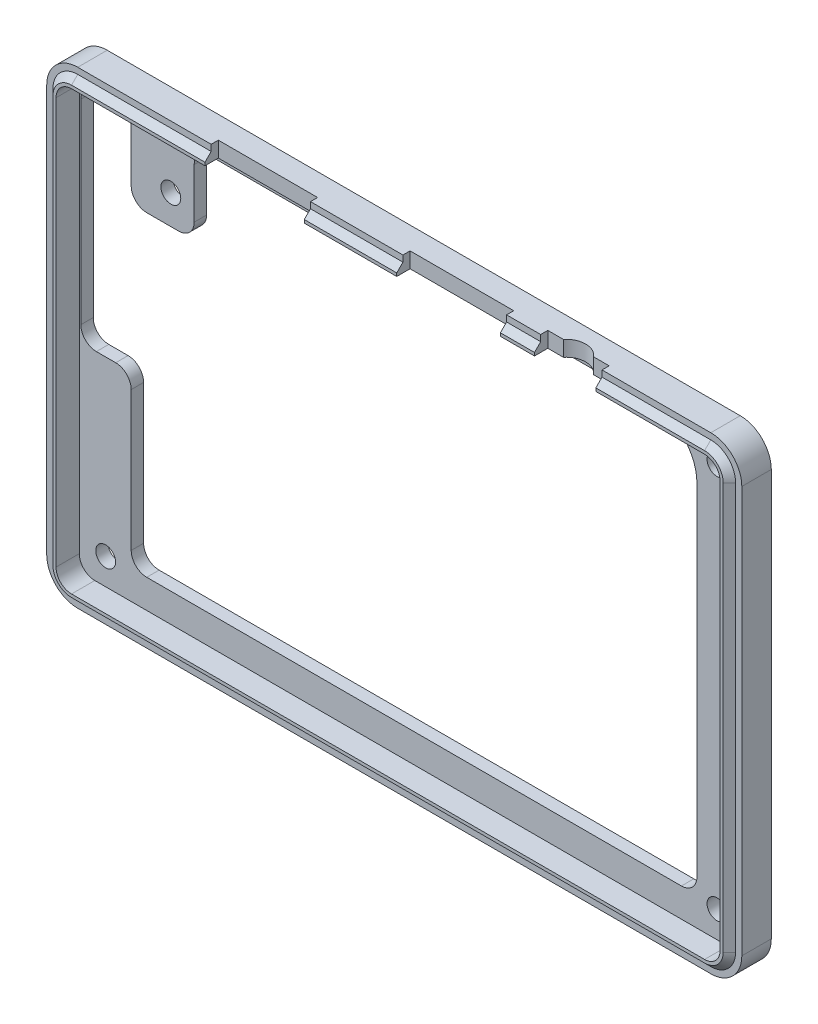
ISO-10303-21;
HEADER;
FILE_DESCRIPTION(('STEP AP214'),'2;1');
FILE_NAME('part.step','',(''),(''),'','','');
FILE_SCHEMA(('AUTOMOTIVE_DESIGN { 1 0 10303 214 1 1 1 1 }'));
ENDSEC;
DATA;
#1=APPLICATION_CONTEXT('core data for automotive mechanical design processes');
#2=APPLICATION_PROTOCOL_DEFINITION('international standard','automotive_design',2000,#1);
#3=PRODUCT_CONTEXT('',#1,'mechanical');
#4=PRODUCT('Part','Part','',(#3));
#5=PRODUCT_RELATED_PRODUCT_CATEGORY('part','',(#4));
#6=PRODUCT_DEFINITION_FORMATION('','',#4);
#7=PRODUCT_DEFINITION_CONTEXT('part definition',#1,'design');
#8=PRODUCT_DEFINITION('design','',#6,#7);
#9=PRODUCT_DEFINITION_SHAPE('','',#8);
#10=(LENGTH_UNIT() NAMED_UNIT(*) SI_UNIT(.MILLI.,.METRE.));
#11=(NAMED_UNIT(*) PLANE_ANGLE_UNIT() SI_UNIT($,.RADIAN.));
#12=(NAMED_UNIT(*) SI_UNIT($,.STERADIAN.) SOLID_ANGLE_UNIT());
#13=UNCERTAINTY_MEASURE_WITH_UNIT(LENGTH_MEASURE(1.E-05),#10,'distance_accuracy_value','');
#14=(GEOMETRIC_REPRESENTATION_CONTEXT(3) GLOBAL_UNCERTAINTY_ASSIGNED_CONTEXT((#13)) GLOBAL_UNIT_ASSIGNED_CONTEXT((#10,
#11,#12)) REPRESENTATION_CONTEXT('',''));
#15=CARTESIAN_POINT('',(0.,0.,0.));
#16=DIRECTION('',(0.,0.,1.));
#17=DIRECTION('',(1.,0.,0.));
#18=AXIS2_PLACEMENT_3D('',#15,#16,#17);
#19=CARTESIAN_POINT('',(2.25,67.75,0.));
#20=DIRECTION('',(0.,0.,-1.));
#21=DIRECTION('',(-1.,0.,0.));
#22=AXIS2_PLACEMENT_3D('',#19,#20,#21);
#23=PLANE('',#22);
#24=CARTESIAN_POINT('',(20.7618492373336,65.7977384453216,0.));
#25=DIRECTION('',(0.,0.,1.));
#26=DIRECTION('',(-1.,0.,0.));
#27=AXIS2_PLACEMENT_3D('',#24,#25,#26);
#28=CIRCLE('',#27,2.5);
#29=CARTESIAN_POINT('',(20.7618492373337,68.2977384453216,0.));
#30=VERTEX_POINT('',#29);
#31=CARTESIAN_POINT('',(18.2618492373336,65.7977384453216,0.));
#32=VERTEX_POINT('',#31);
#33=EDGE_CURVE('E582',#30,#32,#28,.T.);
#34=ORIENTED_EDGE('',*,*,#33,.F.);
#35=DIRECTION('',(-1.,0.,0.));
#36=VECTOR('',#35,1.);
#37=CARTESIAN_POINT('',(20.7618492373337,68.2977384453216,0.));
#38=LINE('',#37,#36);
#39=CARTESIAN_POINT('',(50.7784971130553,68.2977384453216,0.));
#40=VERTEX_POINT('',#39);
#41=EDGE_CURVE('E607',#40,#30,#38,.T.);
#42=ORIENTED_EDGE('',*,*,#41,.F.);
#43=DIRECTION('',(-0.918073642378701,-0.396409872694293,0.));
#44=VECTOR('',#43,1.);
#45=CARTESIAN_POINT('',(50.7784971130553,68.2977384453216,0.));
#46=LINE('',#45,#44);
#47=CARTESIAN_POINT('',(53.2784971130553,69.3771994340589,0.));
#48=VERTEX_POINT('',#47);
#49=EDGE_CURVE('E730',#48,#40,#46,.T.);
#50=ORIENTED_EDGE('',*,*,#49,.F.);
#51=DIRECTION('',(-1.,0.,0.));
#52=VECTOR('',#51,1.);
#53=CARTESIAN_POINT('',(81.9624449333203,69.3771994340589,0.));
#54=LINE('',#53,#52);
#55=CARTESIAN_POINT('',(91.7672519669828,69.3771994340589,0.));
#56=VERTEX_POINT('',#55);
#57=EDGE_CURVE('E727',#56,#48,#54,.T.);
#58=ORIENTED_EDGE('',*,*,#57,.F.);
#59=CARTESIAN_POINT('',(91.7672519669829,61.8771994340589,0.));
#60=DIRECTION('',(0.,0.,1.));
#61=DIRECTION('',(1.,0.,0.));
#62=AXIS2_PLACEMENT_3D('',#59,#60,#61);
#63=CIRCLE('',#62,7.5);
#64=CARTESIAN_POINT('',(99.2672519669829,61.8771994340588,0.));
#65=VERTEX_POINT('',#64);
#66=EDGE_CURVE('E724',#65,#56,#63,.T.);
#67=ORIENTED_EDGE('',*,*,#66,.F.);
#68=DIRECTION('',(0.,1.,0.));
#69=VECTOR('',#68,1.);
#70=CARTESIAN_POINT('',(99.2672519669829,61.8771994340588,0.));
#71=LINE('',#70,#69);
#72=CARTESIAN_POINT('',(99.2672519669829,6.88580153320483,0.));
#73=VERTEX_POINT('',#72);
#74=EDGE_CURVE('E721',#73,#65,#71,.T.);
#75=ORIENTED_EDGE('',*,*,#74,.F.);
#76=CARTESIAN_POINT('',(96.7672519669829,6.88580153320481,0.));
#77=DIRECTION('',(0.,0.,1.));
#78=DIRECTION('',(-1.,0.,0.));
#79=AXIS2_PLACEMENT_3D('',#76,#77,#78);
#80=CIRCLE('',#79,2.5);
#81=CARTESIAN_POINT('',(96.7672519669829,4.38580153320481,0.));
#82=VERTEX_POINT('',#81);
#83=EDGE_CURVE('E718',#82,#73,#80,.T.);
#84=ORIENTED_EDGE('',*,*,#83,.F.);
#85=DIRECTION('',(1.,0.,0.));
#86=VECTOR('',#85,1.);
#87=CARTESIAN_POINT('',(96.7672519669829,4.38580153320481,0.));
#88=LINE('',#87,#86);
#89=CARTESIAN_POINT('',(10.613364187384,4.3858015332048,0.));
#90=VERTEX_POINT('',#89);
#91=EDGE_CURVE('E715',#90,#82,#88,.T.);
#92=ORIENTED_EDGE('',*,*,#91,.F.);
#93=CARTESIAN_POINT('',(10.613364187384,6.8858015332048,0.));
#94=DIRECTION('',(0.,0.,1.));
#95=DIRECTION('',(-1.,0.,0.));
#96=AXIS2_PLACEMENT_3D('',#93,#94,#95);
#97=CIRCLE('',#96,2.5);
#98=CARTESIAN_POINT('',(8.11336418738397,6.8858015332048,0.));
#99=VERTEX_POINT('',#98);
#100=EDGE_CURVE('E712',#99,#90,#97,.T.);
#101=ORIENTED_EDGE('',*,*,#100,.F.);
#102=DIRECTION('',(0.,-1.,0.));
#103=VECTOR('',#102,1.);
#104=CARTESIAN_POINT('',(8.11336418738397,6.8858015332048,0.));
#105=LINE('',#104,#103);
#106=CARTESIAN_POINT('',(8.11336418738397,29.3233688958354,0.));
#107=VERTEX_POINT('',#106);
#108=EDGE_CURVE('E709',#107,#99,#105,.T.);
#109=ORIENTED_EDGE('',*,*,#108,.F.);
#110=CARTESIAN_POINT('',(5.61336418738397,29.3233688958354,0.));
#111=DIRECTION('',(0.,0.,-1.));
#112=DIRECTION('',(-1.,0.,0.));
#113=AXIS2_PLACEMENT_3D('',#110,#111,#112);
#114=CIRCLE('',#113,2.5);
#115=CARTESIAN_POINT('',(5.61336418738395,31.8233688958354,0.));
#116=VERTEX_POINT('',#115);
#117=EDGE_CURVE('E706',#116,#107,#114,.T.);
#118=ORIENTED_EDGE('',*,*,#117,.F.);
#119=DIRECTION('',(1.,0.,0.));
#120=VECTOR('',#119,1.);
#121=CARTESIAN_POINT('',(5.61336418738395,31.8233688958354,0.));
#122=LINE('',#121,#120);
#123=CARTESIAN_POINT('',(2.50000000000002,31.8233688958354,0.));
#124=VERTEX_POINT('',#123);
#125=EDGE_CURVE('E703',#124,#116,#122,.T.);
#126=ORIENTED_EDGE('',*,*,#125,.F.);
#127=CARTESIAN_POINT('',(2.5,34.3233688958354,0.));
#128=DIRECTION('',(0.,0.,1.));
#129=DIRECTION('',(-1.,0.,0.));
#130=AXIS2_PLACEMENT_3D('',#127,#128,#129);
#131=CIRCLE('',#130,2.5);
#132=CARTESIAN_POINT('',(0.,34.3233688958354,0.));
#133=VERTEX_POINT('',#132);
#134=EDGE_CURVE('E700',#133,#124,#131,.T.);
#135=ORIENTED_EDGE('',*,*,#134,.F.);
#136=DIRECTION('',(0.,-1.,0.));
#137=VECTOR('',#136,1.);
#138=CARTESIAN_POINT('',(0.,34.3233688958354,0.));
#139=LINE('',#138,#137);
#140=CARTESIAN_POINT('',(0.,65.7977384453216,0.));
#141=VERTEX_POINT('',#140);
#142=EDGE_CURVE('E697',#141,#133,#139,.T.);
#143=ORIENTED_EDGE('',*,*,#142,.F.);
#144=CARTESIAN_POINT('',(2.5,65.7977384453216,0.));
#145=DIRECTION('',(0.,0.,1.));
#146=DIRECTION('',(1.,0.,0.));
#147=AXIS2_PLACEMENT_3D('',#144,#145,#146);
#148=CIRCLE('',#147,2.5);
#149=CARTESIAN_POINT('',(2.50000000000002,68.2977384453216,0.));
#150=VERTEX_POINT('',#149);
#151=EDGE_CURVE('E694',#150,#141,#148,.T.);
#152=ORIENTED_EDGE('',*,*,#151,.F.);
#153=DIRECTION('',(-1.,0.,0.));
#154=VECTOR('',#153,1.);
#155=CARTESIAN_POINT('',(5.61336418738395,68.2977384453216,0.));
#156=LINE('',#155,#154);
#157=CARTESIAN_POINT('',(5.61336418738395,68.2977384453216,0.));
#158=VERTEX_POINT('',#157);
#159=EDGE_CURVE('E691',#158,#150,#156,.T.);
#160=ORIENTED_EDGE('',*,*,#159,.F.);
#161=CARTESIAN_POINT('',(5.61336418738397,65.7977384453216,0.));
#162=DIRECTION('',(0.,0.,1.));
#163=DIRECTION('',(1.,0.,0.));
#164=AXIS2_PLACEMENT_3D('',#161,#162,#163);
#165=CIRCLE('',#164,2.5);
#166=CARTESIAN_POINT('',(8.11336418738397,65.7977384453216,0.));
#167=VERTEX_POINT('',#166);
#168=EDGE_CURVE('E688',#167,#158,#165,.T.);
#169=ORIENTED_EDGE('',*,*,#168,.F.);
#170=DIRECTION('',(0.,1.,0.));
#171=VECTOR('',#170,1.);
#172=CARTESIAN_POINT('',(8.11336418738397,57.7604408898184,0.));
#173=LINE('',#172,#171);
#174=CARTESIAN_POINT('',(8.11336418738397,57.7604408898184,0.));
#175=VERTEX_POINT('',#174);
#176=EDGE_CURVE('E685',#175,#167,#173,.T.);
#177=ORIENTED_EDGE('',*,*,#176,.F.);
#178=CARTESIAN_POINT('',(10.613364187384,57.7604408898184,0.));
#179=DIRECTION('',(0.,0.,-1.));
#180=DIRECTION('',(-1.,0.,0.));
#181=AXIS2_PLACEMENT_3D('',#178,#179,#180);
#182=CIRCLE('',#181,2.5);
#183=CARTESIAN_POINT('',(10.613364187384,55.2604408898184,0.));
#184=VERTEX_POINT('',#183);
#185=EDGE_CURVE('E682',#184,#175,#182,.T.);
#186=ORIENTED_EDGE('',*,*,#185,.F.);
#187=DIRECTION('',(-1.,0.,0.));
#188=VECTOR('',#187,1.);
#189=CARTESIAN_POINT('',(10.613364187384,55.2604408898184,0.));
#190=LINE('',#189,#188);
#191=CARTESIAN_POINT('',(15.7618492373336,55.2604408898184,0.));
#192=VERTEX_POINT('',#191);
#193=EDGE_CURVE('E679',#192,#184,#190,.T.);
#194=ORIENTED_EDGE('',*,*,#193,.F.);
#195=CARTESIAN_POINT('',(15.7618492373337,57.7604408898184,0.));
#196=DIRECTION('',(0.,0.,-1.));
#197=DIRECTION('',(-1.,0.,0.));
#198=AXIS2_PLACEMENT_3D('',#195,#196,#197);
#199=CIRCLE('',#198,2.5);
#200=CARTESIAN_POINT('',(18.2618492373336,57.7604408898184,0.));
#201=VERTEX_POINT('',#200);
#202=EDGE_CURVE('E676',#201,#192,#199,.T.);
#203=ORIENTED_EDGE('',*,*,#202,.F.);
#204=DIRECTION('',(0.,-1.,0.));
#205=VECTOR('',#204,1.);
#206=CARTESIAN_POINT('',(18.2618492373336,57.7604408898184,0.));
#207=LINE('',#206,#205);
#208=EDGE_CURVE('E673',#32,#201,#207,.T.);
#209=ORIENTED_EDGE('',*,*,#208,.F.);
#210=EDGE_LOOP('',(#34,#42,#50,#58,#67,#75,#84,#92,#101,#109,#118,#126,#135,#143,#152,#160,#169,
#177,#186,#194,#203,#209));
#211=FACE_BOUND('',#210,.T.);
#212=CARTESIAN_POINT('',(102.5,4.,0.));
#213=DIRECTION('',(0.,0.,1.));
#214=DIRECTION('',(1.,0.,0.));
#215=AXIS2_PLACEMENT_3D('',#212,#213,#214);
#216=CIRCLE('',#215,1.60000000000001);
#217=CARTESIAN_POINT('',(104.1,4.,0.));
#218=VERTEX_POINT('',#217);
#219=EDGE_CURVE('E578',#218,#218,#216,.T.);
#220=ORIENTED_EDGE('',*,*,#219,.F.);
#221=EDGE_LOOP('',(#220));
#222=FACE_BOUND('',#221,.T.);
#223=CARTESIAN_POINT('',(102.5,66.,0.));
#224=DIRECTION('',(0.,0.,1.));
#225=DIRECTION('',(1.,0.,0.));
#226=AXIS2_PLACEMENT_3D('',#223,#224,#225);
#227=CIRCLE('',#226,1.60000000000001);
#228=CARTESIAN_POINT('',(104.1,66.,0.));
#229=VERTEX_POINT('',#228);
#230=EDGE_CURVE('E595',#229,#229,#227,.T.);
#231=ORIENTED_EDGE('',*,*,#230,.F.);
#232=EDGE_LOOP('',(#231));
#233=FACE_BOUND('',#232,.T.);
#234=CARTESIAN_POINT('',(14.5,60.,0.));
#235=DIRECTION('',(0.,0.,1.));
#236=DIRECTION('',(1.,0.,0.));
#237=AXIS2_PLACEMENT_3D('',#234,#235,#236);
#238=CIRCLE('',#237,1.6);
#239=CARTESIAN_POINT('',(16.1,60.,0.));
#240=VERTEX_POINT('',#239);
#241=EDGE_CURVE('E589',#240,#240,#238,.T.);
#242=ORIENTED_EDGE('',*,*,#241,.F.);
#243=EDGE_LOOP('',(#242));
#244=FACE_BOUND('',#243,.T.);
#245=CARTESIAN_POINT('',(4.,4.,0.));
#246=DIRECTION('',(0.,0.,1.));
#247=DIRECTION('',(1.,0.,0.));
#248=AXIS2_PLACEMENT_3D('',#245,#246,#247);
#249=CIRCLE('',#248,1.6);
#250=CARTESIAN_POINT('',(5.6,4.,0.));
#251=VERTEX_POINT('',#250);
#252=EDGE_CURVE('E583',#251,#251,#249,.T.);
#253=ORIENTED_EDGE('',*,*,#252,.F.);
#254=EDGE_LOOP('',(#253));
#255=FACE_BOUND('',#254,.T.);
#256=DIRECTION('',(-1.,0.,0.));
#257=VECTOR('',#256,1.);
#258=CARTESIAN_POINT('',(104.25,70.25,0.));
#259=LINE('',#258,#257);
#260=CARTESIAN_POINT('',(104.25,70.25,0.));
#261=VERTEX_POINT('',#260);
#262=CARTESIAN_POINT('',(2.24999999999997,70.25,0.));
#263=VERTEX_POINT('',#262);
#264=EDGE_CURVE('E805',#261,#263,#259,.T.);
#265=ORIENTED_EDGE('',*,*,#264,.T.);
#266=CARTESIAN_POINT('',(2.24999999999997,67.75,0.));
#267=DIRECTION('',(0.,0.,1.));
#268=DIRECTION('',(1.,0.,0.));
#269=AXIS2_PLACEMENT_3D('',#266,#267,#268);
#270=CIRCLE('',#269,2.5);
#271=CARTESIAN_POINT('',(-0.250000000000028,67.75,0.));
#272=VERTEX_POINT('',#271);
#273=EDGE_CURVE('E807',#263,#272,#270,.T.);
#274=ORIENTED_EDGE('',*,*,#273,.T.);
#275=DIRECTION('',(0.,-1.,0.));
#276=VECTOR('',#275,1.);
#277=CARTESIAN_POINT('',(-0.250000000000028,2.25,0.));
#278=LINE('',#277,#276);
#279=CARTESIAN_POINT('',(-0.250000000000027,2.25,0.));
#280=VERTEX_POINT('',#279);
#281=EDGE_CURVE('E810',#272,#280,#278,.T.);
#282=ORIENTED_EDGE('',*,*,#281,.T.);
#283=CARTESIAN_POINT('',(2.24999999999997,2.25,0.));
#284=DIRECTION('',(0.,0.,1.));
#285=DIRECTION('',(-1.,0.,0.));
#286=AXIS2_PLACEMENT_3D('',#283,#284,#285);
#287=CIRCLE('',#286,2.5);
#288=CARTESIAN_POINT('',(2.24999999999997,-0.25,0.));
#289=VERTEX_POINT('',#288);
#290=EDGE_CURVE('E813',#280,#289,#287,.T.);
#291=ORIENTED_EDGE('',*,*,#290,.T.);
#292=DIRECTION('',(1.,0.,0.));
#293=VECTOR('',#292,1.);
#294=CARTESIAN_POINT('',(104.25,-0.249999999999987,0.));
#295=LINE('',#294,#293);
#296=CARTESIAN_POINT('',(104.25,-0.249999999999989,0.));
#297=VERTEX_POINT('',#296);
#298=EDGE_CURVE('E816',#289,#297,#295,.T.);
#299=ORIENTED_EDGE('',*,*,#298,.T.);
#300=CARTESIAN_POINT('',(104.25,2.25000000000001,0.));
#301=DIRECTION('',(0.,0.,1.));
#302=DIRECTION('',(1.,0.,0.));
#303=AXIS2_PLACEMENT_3D('',#300,#301,#302);
#304=CIRCLE('',#303,2.5);
#305=CARTESIAN_POINT('',(106.75,2.25000000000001,0.));
#306=VERTEX_POINT('',#305);
#307=EDGE_CURVE('E819',#297,#306,#304,.T.);
#308=ORIENTED_EDGE('',*,*,#307,.T.);
#309=DIRECTION('',(0.,1.,0.));
#310=VECTOR('',#309,1.);
#311=CARTESIAN_POINT('',(106.75,2.25000000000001,0.));
#312=LINE('',#311,#310);
#313=CARTESIAN_POINT('',(106.75,67.75,0.));
#314=VERTEX_POINT('',#313);
#315=EDGE_CURVE('E822',#306,#314,#312,.T.);
#316=ORIENTED_EDGE('',*,*,#315,.T.);
#317=CARTESIAN_POINT('',(104.25,67.75,0.));
#318=DIRECTION('',(0.,0.,1.));
#319=DIRECTION('',(1.,0.,0.));
#320=AXIS2_PLACEMENT_3D('',#317,#318,#319);
#321=CIRCLE('',#320,2.50000000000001);
#322=EDGE_CURVE('E802',#314,#261,#321,.T.);
#323=ORIENTED_EDGE('',*,*,#322,.T.);
#324=EDGE_LOOP('',(#265,#274,#282,#291,#299,#308,#316,#323));
#325=FACE_BOUND('',#324,.T.);
#326=ADVANCED_FACE('F35',(#211,#222,#233,#244,#255,#325),#23,.F.);
#327=CARTESIAN_POINT('',(0.,0.,1.6));
#328=DIRECTION('',(0.,0.,1.));
#329=DIRECTION('',(1.,0.,0.));
#330=AXIS2_PLACEMENT_3D('',#327,#328,#329);
#331=PLANE('',#330);
#332=DIRECTION('',(0.,1.,0.));
#333=VECTOR('',#332,1.);
#334=CARTESIAN_POINT('',(84.2189766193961,61.3404545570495,1.6));
#335=LINE('',#334,#333);
#336=CARTESIAN_POINT('',(84.2189766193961,70.25,1.6));
#337=VERTEX_POINT('',#336);
#338=CARTESIAN_POINT('',(84.2189766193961,72.75,1.6));
#339=VERTEX_POINT('',#338);
#340=EDGE_CURVE('E11',#337,#339,#335,.T.);
#341=ORIENTED_EDGE('',*,*,#340,.F.);
#342=DIRECTION('',(1.,0.,0.));
#343=VECTOR('',#342,1.);
#344=CARTESIAN_POINT('',(86.728343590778,70.25,1.6));
#345=LINE('',#344,#343);
#346=CARTESIAN_POINT('',(86.728343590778,70.25,1.6));
#347=VERTEX_POINT('',#346);
#348=EDGE_CURVE('E470',#337,#347,#345,.T.);
#349=ORIENTED_EDGE('',*,*,#348,.T.);
#350=DIRECTION('',(0.,1.,0.));
#351=VECTOR('',#350,1.);
#352=CARTESIAN_POINT('',(86.728343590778,70.25,1.6));
#353=LINE('',#352,#351);
#354=CARTESIAN_POINT('',(86.728343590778,72.75,1.6));
#355=VERTEX_POINT('',#354);
#356=EDGE_CURVE('E466',#347,#355,#353,.T.);
#357=ORIENTED_EDGE('',*,*,#356,.T.);
#358=DIRECTION('',(-1.,0.,0.));
#359=VECTOR('',#358,1.);
#360=CARTESIAN_POINT('',(86.728343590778,72.75,1.6));
#361=LINE('',#360,#359);
#362=EDGE_CURVE('E458',#355,#339,#361,.T.);
#363=ORIENTED_EDGE('',*,*,#362,.T.);
#364=EDGE_LOOP('',(#341,#349,#357,#363));
#365=FACE_BOUND('',#364,.T.);
#366=ADVANCED_FACE('F464',(#365),#331,.T.);
#367=CARTESIAN_POINT('',(104.25,67.75,2.75));
#368=DIRECTION('',(0.,0.,1.));
#369=DIRECTION('',(1.,0.,0.));
#370=AXIS2_PLACEMENT_3D('',#367,#368,#369);
#371=PLANE('',#370);
#372=DIRECTION('',(-1.,0.,0.));
#373=VECTOR('',#372,1.);
#374=CARTESIAN_POINT('',(104.25,71.75,2.75));
#375=LINE('',#374,#373);
#376=CARTESIAN_POINT('',(23.75,71.75,2.75));
#377=VERTEX_POINT('',#376);
#378=CARTESIAN_POINT('',(2.25,71.75,2.75));
#379=VERTEX_POINT('',#378);
#380=EDGE_CURVE('E555',#377,#379,#375,.T.);
#381=ORIENTED_EDGE('',*,*,#380,.F.);
#382=DIRECTION('',(0.,1.,0.));
#383=VECTOR('',#382,1.);
#384=CARTESIAN_POINT('',(23.75,67.75,2.75));
#385=LINE('',#384,#383);
#386=CARTESIAN_POINT('',(23.75,72.75,2.75));
#387=VERTEX_POINT('',#386);
#388=EDGE_CURVE('E959',#377,#387,#385,.T.);
#389=ORIENTED_EDGE('',*,*,#388,.T.);
#390=DIRECTION('',(-1.,0.,0.));
#391=VECTOR('',#390,1.);
#392=CARTESIAN_POINT('',(104.25,72.75,2.75));
#393=LINE('',#392,#391);
#394=CARTESIAN_POINT('',(2.24999999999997,72.75,2.75));
#395=VERTEX_POINT('',#394);
#396=EDGE_CURVE('E846',#387,#395,#393,.T.);
#397=ORIENTED_EDGE('',*,*,#396,.T.);
#398=CARTESIAN_POINT('',(2.24999999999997,67.75,2.75));
#399=DIRECTION('',(0.,0.,1.));
#400=DIRECTION('',(1.,0.,0.));
#401=AXIS2_PLACEMENT_3D('',#398,#399,#400);
#402=CIRCLE('',#401,5.);
#403=CARTESIAN_POINT('',(-2.75000000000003,67.75,2.75));
#404=VERTEX_POINT('',#403);
#405=EDGE_CURVE('E850',#395,#404,#402,.T.);
#406=ORIENTED_EDGE('',*,*,#405,.T.);
#407=DIRECTION('',(0.,-1.,0.));
#408=VECTOR('',#407,1.);
#409=CARTESIAN_POINT('',(-2.75000000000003,2.25,2.75));
#410=LINE('',#409,#408);
#411=CARTESIAN_POINT('',(-2.75000000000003,2.25,2.75));
#412=VERTEX_POINT('',#411);
#413=EDGE_CURVE('E853',#404,#412,#410,.T.);
#414=ORIENTED_EDGE('',*,*,#413,.T.);
#415=CARTESIAN_POINT('',(2.24999999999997,2.25,2.75));
#416=DIRECTION('',(0.,0.,1.));
#417=DIRECTION('',(-1.,0.,0.));
#418=AXIS2_PLACEMENT_3D('',#415,#416,#417);
#419=CIRCLE('',#418,5.);
#420=CARTESIAN_POINT('',(2.24999999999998,-2.75,2.75));
#421=VERTEX_POINT('',#420);
#422=EDGE_CURVE('E855',#412,#421,#419,.T.);
#423=ORIENTED_EDGE('',*,*,#422,.T.);
#424=DIRECTION('',(1.,0.,0.));
#425=VECTOR('',#424,1.);
#426=CARTESIAN_POINT('',(104.25,-2.74999999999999,2.75));
#427=LINE('',#426,#425);
#428=CARTESIAN_POINT('',(104.25,-2.74999999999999,2.75));
#429=VERTEX_POINT('',#428);
#430=EDGE_CURVE('E857',#421,#429,#427,.T.);
#431=ORIENTED_EDGE('',*,*,#430,.T.);
#432=CARTESIAN_POINT('',(104.25,2.25000000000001,2.75));
#433=DIRECTION('',(0.,0.,1.));
#434=DIRECTION('',(1.,0.,0.));
#435=AXIS2_PLACEMENT_3D('',#432,#433,#434);
#436=CIRCLE('',#435,5.);
#437=CARTESIAN_POINT('',(109.25,2.25000000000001,2.75));
#438=VERTEX_POINT('',#437);
#439=EDGE_CURVE('E859',#429,#438,#436,.T.);
#440=ORIENTED_EDGE('',*,*,#439,.T.);
#441=DIRECTION('',(0.,1.,0.));
#442=VECTOR('',#441,1.);
#443=CARTESIAN_POINT('',(109.25,2.25000000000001,2.75));
#444=LINE('',#443,#442);
#445=CARTESIAN_POINT('',(109.25,67.75,2.75));
#446=VERTEX_POINT('',#445);
#447=EDGE_CURVE('E861',#438,#446,#444,.T.);
#448=ORIENTED_EDGE('',*,*,#447,.T.);
#449=CARTESIAN_POINT('',(104.25,67.75,2.75));
#450=DIRECTION('',(0.,0.,1.));
#451=DIRECTION('',(1.,0.,0.));
#452=AXIS2_PLACEMENT_3D('',#449,#450,#451);
#453=CIRCLE('',#452,5.);
#454=CARTESIAN_POINT('',(104.25,72.75,2.75));
#455=VERTEX_POINT('',#454);
#456=EDGE_CURVE('E843',#446,#455,#453,.T.);
#457=ORIENTED_EDGE('',*,*,#456,.T.);
#458=CARTESIAN_POINT('',(86.728343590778,72.75,2.75));
#459=VERTEX_POINT('',#458);
#460=EDGE_CURVE('E847',#455,#459,#393,.T.);
#461=ORIENTED_EDGE('',*,*,#460,.T.);
#462=DIRECTION('',(0.,1.,0.));
#463=VECTOR('',#462,1.);
#464=CARTESIAN_POINT('',(86.728343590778,67.75,2.75));
#465=LINE('',#464,#463);
#466=CARTESIAN_POINT('',(86.728343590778,71.75,2.75));
#467=VERTEX_POINT('',#466);
#468=EDGE_CURVE('E499',#467,#459,#465,.T.);
#469=ORIENTED_EDGE('',*,*,#468,.F.);
#470=CARTESIAN_POINT('',(104.25,71.75,2.75));
#471=VERTEX_POINT('',#470);
#472=EDGE_CURVE('E556',#471,#467,#375,.T.);
#473=ORIENTED_EDGE('',*,*,#472,.F.);
#474=CARTESIAN_POINT('',(104.25,67.75,2.75));
#475=DIRECTION('',(0.,0.,1.));
#476=DIRECTION('',(1.,0.,0.));
#477=AXIS2_PLACEMENT_3D('',#474,#475,#476);
#478=CIRCLE('',#477,4.);
#479=CARTESIAN_POINT('',(108.25,67.75,2.75));
#480=VERTEX_POINT('',#479);
#481=EDGE_CURVE('E552',#480,#471,#478,.T.);
#482=ORIENTED_EDGE('',*,*,#481,.F.);
#483=DIRECTION('',(0.,1.,0.));
#484=VECTOR('',#483,1.);
#485=CARTESIAN_POINT('',(108.25,2.25000000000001,2.75));
#486=LINE('',#485,#484);
#487=CARTESIAN_POINT('',(108.25,2.25000000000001,2.75));
#488=VERTEX_POINT('',#487);
#489=EDGE_CURVE('E575',#488,#480,#486,.T.);
#490=ORIENTED_EDGE('',*,*,#489,.F.);
#491=CARTESIAN_POINT('',(104.25,2.25000000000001,2.75));
#492=DIRECTION('',(0.,0.,1.));
#493=DIRECTION('',(1.,0.,0.));
#494=AXIS2_PLACEMENT_3D('',#491,#492,#493);
#495=CIRCLE('',#494,4.00000000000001);
#496=CARTESIAN_POINT('',(104.25,-1.75,2.75));
#497=VERTEX_POINT('',#496);
#498=EDGE_CURVE('E572',#497,#488,#495,.T.);
#499=ORIENTED_EDGE('',*,*,#498,.F.);
#500=DIRECTION('',(1.,0.,0.));
#501=VECTOR('',#500,1.);
#502=CARTESIAN_POINT('',(104.25,-1.75,2.75));
#503=LINE('',#502,#501);
#504=CARTESIAN_POINT('',(2.25,-1.75000000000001,2.75));
#505=VERTEX_POINT('',#504);
#506=EDGE_CURVE('E569',#505,#497,#503,.T.);
#507=ORIENTED_EDGE('',*,*,#506,.F.);
#508=CARTESIAN_POINT('',(2.25,2.25,2.75));
#509=DIRECTION('',(0.,0.,1.));
#510=DIRECTION('',(-1.,0.,0.));
#511=AXIS2_PLACEMENT_3D('',#508,#509,#510);
#512=CIRCLE('',#511,4.);
#513=CARTESIAN_POINT('',(-1.75,2.25,2.75));
#514=VERTEX_POINT('',#513);
#515=EDGE_CURVE('E566',#514,#505,#512,.T.);
#516=ORIENTED_EDGE('',*,*,#515,.F.);
#517=DIRECTION('',(0.,-1.,0.));
#518=VECTOR('',#517,1.);
#519=CARTESIAN_POINT('',(-1.75,2.25,2.75));
#520=LINE('',#519,#518);
#521=CARTESIAN_POINT('',(-1.74999999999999,67.75,2.75));
#522=VERTEX_POINT('',#521);
#523=EDGE_CURVE('E563',#522,#514,#520,.T.);
#524=ORIENTED_EDGE('',*,*,#523,.F.);
#525=CARTESIAN_POINT('',(2.25,67.75,2.75));
#526=DIRECTION('',(0.,0.,1.));
#527=DIRECTION('',(1.,0.,0.));
#528=AXIS2_PLACEMENT_3D('',#525,#526,#527);
#529=CIRCLE('',#528,4.);
#530=EDGE_CURVE('E559',#379,#522,#529,.T.);
#531=ORIENTED_EDGE('',*,*,#530,.F.);
#532=EDGE_LOOP('',(#381,#389,#397,#406,#414,#423,#431,#440,#448,#457,#461,#469,#473,#482,#490,
#499,#507,#516,#524,#531));
#533=FACE_BOUND('',#532,.T.);
#534=ADVANCED_FACE('F956',(#533),#371,.T.);
#535=CARTESIAN_POINT('',(54.65,72.75,2.75));
#536=VERTEX_POINT('',#535);
#537=CARTESIAN_POINT('',(39.75,72.75,2.75));
#538=VERTEX_POINT('',#537);
#539=EDGE_CURVE('E945',#536,#538,#393,.T.);
#540=ORIENTED_EDGE('',*,*,#539,.T.);
#541=DIRECTION('',(0.,-1.,0.));
#542=VECTOR('',#541,1.);
#543=CARTESIAN_POINT('',(39.75,67.75,2.75));
#544=LINE('',#543,#542);
#545=CARTESIAN_POINT('',(39.75,71.75,2.75));
#546=VERTEX_POINT('',#545);
#547=EDGE_CURVE('E1148',#538,#546,#544,.T.);
#548=ORIENTED_EDGE('',*,*,#547,.T.);
#549=CARTESIAN_POINT('',(54.65,71.75,2.75));
#550=VERTEX_POINT('',#549);
#551=EDGE_CURVE('E1109',#550,#546,#375,.T.);
#552=ORIENTED_EDGE('',*,*,#551,.F.);
#553=DIRECTION('',(0.,-1.,0.));
#554=VECTOR('',#553,1.);
#555=CARTESIAN_POINT('',(54.65,67.75,2.75));
#556=LINE('',#555,#554);
#557=EDGE_CURVE('E519',#536,#550,#556,.T.);
#558=ORIENTED_EDGE('',*,*,#557,.F.);
#559=EDGE_LOOP('',(#540,#548,#552,#558));
#560=FACE_BOUND('',#559,.T.);
#561=ADVANCED_FACE('F1051',(#560),#371,.T.);
#562=CARTESIAN_POINT('',(104.25,67.75,3.75));
#563=DIRECTION('',(0.,0.,1.));
#564=DIRECTION('',(1.,0.,0.));
#565=AXIS2_PLACEMENT_3D('',#562,#563,#564);
#566=PLANE('',#565);
#567=DIRECTION('',(-1.,0.,0.));
#568=VECTOR('',#567,1.);
#569=CARTESIAN_POINT('',(104.25,70.25,3.75));
#570=LINE('',#569,#568);
#571=CARTESIAN_POINT('',(23.75,70.25,3.75));
#572=VERTEX_POINT('',#571);
#573=CARTESIAN_POINT('',(2.25,70.25,3.75));
#574=VERTEX_POINT('',#573);
#575=EDGE_CURVE('E528',#572,#574,#570,.T.);
#576=ORIENTED_EDGE('',*,*,#575,.F.);
#577=DIRECTION('',(0.,1.,0.));
#578=VECTOR('',#577,1.);
#579=CARTESIAN_POINT('',(23.75,67.75,3.75));
#580=LINE('',#579,#578);
#581=CARTESIAN_POINT('',(23.75,70.75,3.75));
#582=VERTEX_POINT('',#581);
#583=EDGE_CURVE('E1120',#572,#582,#580,.T.);
#584=ORIENTED_EDGE('',*,*,#583,.T.);
#585=DIRECTION('',(-1.,0.,0.));
#586=VECTOR('',#585,1.);
#587=CARTESIAN_POINT('',(2.25,70.75,3.75));
#588=LINE('',#587,#586);
#589=CARTESIAN_POINT('',(2.25,70.75,3.75));
#590=VERTEX_POINT('',#589);
#591=EDGE_CURVE('E879',#582,#590,#588,.T.);
#592=ORIENTED_EDGE('',*,*,#591,.T.);
#593=CARTESIAN_POINT('',(2.25,67.75,3.75));
#594=DIRECTION('',(0.,0.,1.));
#595=DIRECTION('',(1.,0.,0.));
#596=AXIS2_PLACEMENT_3D('',#593,#594,#595);
#597=CIRCLE('',#596,2.99999999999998);
#598=CARTESIAN_POINT('',(-0.74999999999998,67.75,3.75));
#599=VERTEX_POINT('',#598);
#600=EDGE_CURVE('E883',#590,#599,#597,.T.);
#601=ORIENTED_EDGE('',*,*,#600,.T.);
#602=DIRECTION('',(0.,-1.,0.));
#603=VECTOR('',#602,1.);
#604=CARTESIAN_POINT('',(-0.749999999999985,2.25,3.75));
#605=LINE('',#604,#603);
#606=CARTESIAN_POINT('',(-0.749999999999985,2.25,3.75));
#607=VERTEX_POINT('',#606);
#608=EDGE_CURVE('E888',#599,#607,#605,.T.);
#609=ORIENTED_EDGE('',*,*,#608,.T.);
#610=CARTESIAN_POINT('',(2.25,2.25,3.75));
#611=DIRECTION('',(0.,0.,1.));
#612=DIRECTION('',(1.,0.,0.));
#613=AXIS2_PLACEMENT_3D('',#610,#611,#612);
#614=CIRCLE('',#613,2.99999999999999);
#615=CARTESIAN_POINT('',(2.25,-0.74999999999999,3.75));
#616=VERTEX_POINT('',#615);
#617=EDGE_CURVE('E892',#607,#616,#614,.T.);
#618=ORIENTED_EDGE('',*,*,#617,.T.);
#619=DIRECTION('',(1.,0.,0.));
#620=VECTOR('',#619,1.);
#621=CARTESIAN_POINT('',(104.25,-0.749999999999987,3.75));
#622=LINE('',#621,#620);
#623=CARTESIAN_POINT('',(104.25,-0.749999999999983,3.75));
#624=VERTEX_POINT('',#623);
#625=EDGE_CURVE('E896',#616,#624,#622,.T.);
#626=ORIENTED_EDGE('',*,*,#625,.T.);
#627=CARTESIAN_POINT('',(104.25,2.25000000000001,3.75));
#628=DIRECTION('',(0.,0.,1.));
#629=DIRECTION('',(1.,0.,0.));
#630=AXIS2_PLACEMENT_3D('',#627,#628,#629);
#631=CIRCLE('',#630,2.99999999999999);
#632=CARTESIAN_POINT('',(107.25,2.25000000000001,3.75));
#633=VERTEX_POINT('',#632);
#634=EDGE_CURVE('E894',#624,#633,#631,.T.);
#635=ORIENTED_EDGE('',*,*,#634,.T.);
#636=DIRECTION('',(0.,1.,0.));
#637=VECTOR('',#636,1.);
#638=CARTESIAN_POINT('',(107.25,67.75,3.75));
#639=LINE('',#638,#637);
#640=CARTESIAN_POINT('',(107.25,67.75,3.75));
#641=VERTEX_POINT('',#640);
#642=EDGE_CURVE('E890',#633,#641,#639,.T.);
#643=ORIENTED_EDGE('',*,*,#642,.T.);
#644=CARTESIAN_POINT('',(104.25,67.75,3.75));
#645=DIRECTION('',(0.,0.,1.));
#646=DIRECTION('',(1.,0.,0.));
#647=AXIS2_PLACEMENT_3D('',#644,#645,#646);
#648=CIRCLE('',#647,2.99999999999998);
#649=CARTESIAN_POINT('',(104.25,70.75,3.75));
#650=VERTEX_POINT('',#649);
#651=EDGE_CURVE('E886',#641,#650,#648,.T.);
#652=ORIENTED_EDGE('',*,*,#651,.T.);
#653=CARTESIAN_POINT('',(86.728343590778,70.75,3.75));
#654=VERTEX_POINT('',#653);
#655=EDGE_CURVE('E880',#650,#654,#588,.T.);
#656=ORIENTED_EDGE('',*,*,#655,.T.);
#657=DIRECTION('',(0.,1.,0.));
#658=VECTOR('',#657,1.);
#659=CARTESIAN_POINT('',(86.728343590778,67.75,3.75));
#660=LINE('',#659,#658);
#661=CARTESIAN_POINT('',(86.728343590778,70.25,3.75));
#662=VERTEX_POINT('',#661);
#663=EDGE_CURVE('E494',#662,#654,#660,.T.);
#664=ORIENTED_EDGE('',*,*,#663,.F.);
#665=CARTESIAN_POINT('',(104.25,70.25,3.75));
#666=VERTEX_POINT('',#665);
#667=EDGE_CURVE('E530',#666,#662,#570,.T.);
#668=ORIENTED_EDGE('',*,*,#667,.F.);
#669=CARTESIAN_POINT('',(104.25,67.75,3.75));
#670=DIRECTION('',(0.,0.,1.));
#671=DIRECTION('',(1.,0.,0.));
#672=AXIS2_PLACEMENT_3D('',#669,#670,#671);
#673=CIRCLE('',#672,2.50000000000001);
#674=CARTESIAN_POINT('',(106.75,67.75,3.75));
#675=VERTEX_POINT('',#674);
#676=EDGE_CURVE('E525',#675,#666,#673,.T.);
#677=ORIENTED_EDGE('',*,*,#676,.F.);
#678=DIRECTION('',(0.,1.,0.));
#679=VECTOR('',#678,1.);
#680=CARTESIAN_POINT('',(106.75,2.25000000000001,3.75));
#681=LINE('',#680,#679);
#682=CARTESIAN_POINT('',(106.75,2.25,3.75));
#683=VERTEX_POINT('',#682);
#684=EDGE_CURVE('E549',#683,#675,#681,.T.);
#685=ORIENTED_EDGE('',*,*,#684,.F.);
#686=CARTESIAN_POINT('',(104.25,2.25000000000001,3.75));
#687=DIRECTION('',(0.,0.,1.));
#688=DIRECTION('',(1.,0.,0.));
#689=AXIS2_PLACEMENT_3D('',#686,#687,#688);
#690=CIRCLE('',#689,2.5);
#691=CARTESIAN_POINT('',(104.25,-0.249999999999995,3.75));
#692=VERTEX_POINT('',#691);
#693=EDGE_CURVE('E546',#692,#683,#690,.T.);
#694=ORIENTED_EDGE('',*,*,#693,.F.);
#695=DIRECTION('',(1.,0.,0.));
#696=VECTOR('',#695,1.);
#697=CARTESIAN_POINT('',(104.25,-0.249999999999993,3.75));
#698=LINE('',#697,#696);
#699=CARTESIAN_POINT('',(2.25,-0.250000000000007,3.75));
#700=VERTEX_POINT('',#699);
#701=EDGE_CURVE('E543',#700,#692,#698,.T.);
#702=ORIENTED_EDGE('',*,*,#701,.F.);
#703=CARTESIAN_POINT('',(2.25,2.25,3.75));
#704=DIRECTION('',(0.,0.,1.));
#705=DIRECTION('',(-1.,0.,0.));
#706=AXIS2_PLACEMENT_3D('',#703,#704,#705);
#707=CIRCLE('',#706,2.5);
#708=CARTESIAN_POINT('',(-0.25,2.25,3.75));
#709=VERTEX_POINT('',#708);
#710=EDGE_CURVE('E540',#709,#700,#707,.T.);
#711=ORIENTED_EDGE('',*,*,#710,.F.);
#712=DIRECTION('',(0.,-1.,0.));
#713=VECTOR('',#712,1.);
#714=CARTESIAN_POINT('',(-0.25,2.25,3.75));
#715=LINE('',#714,#713);
#716=CARTESIAN_POINT('',(-0.25,67.75,3.75));
#717=VERTEX_POINT('',#716);
#718=EDGE_CURVE('E537',#717,#709,#715,.T.);
#719=ORIENTED_EDGE('',*,*,#718,.F.);
#720=CARTESIAN_POINT('',(2.25,67.75,3.75));
#721=DIRECTION('',(0.,0.,1.));
#722=DIRECTION('',(1.,0.,0.));
#723=AXIS2_PLACEMENT_3D('',#720,#721,#722);
#724=CIRCLE('',#723,2.5);
#725=EDGE_CURVE('E533',#574,#717,#724,.T.);
#726=ORIENTED_EDGE('',*,*,#725,.F.);
#727=EDGE_LOOP('',(#576,#584,#592,#601,#609,#618,#626,#635,#643,#652,#656,#664,#668,#677,#685,
#694,#702,#711,#719,#726));
#728=FACE_BOUND('',#727,.T.);
#729=ADVANCED_FACE('F1118',(#728),#566,.T.);
#730=CARTESIAN_POINT('',(54.65,70.75,3.75));
#731=VERTEX_POINT('',#730);
#732=CARTESIAN_POINT('',(39.75,70.75,3.75));
#733=VERTEX_POINT('',#732);
#734=EDGE_CURVE('E1121',#731,#733,#588,.T.);
#735=ORIENTED_EDGE('',*,*,#734,.T.);
#736=DIRECTION('',(0.,-1.,0.));
#737=VECTOR('',#736,1.);
#738=CARTESIAN_POINT('',(39.75,67.75,3.75));
#739=LINE('',#738,#737);
#740=CARTESIAN_POINT('',(39.75,70.25,3.75));
#741=VERTEX_POINT('',#740);
#742=EDGE_CURVE('E1150',#733,#741,#739,.T.);
#743=ORIENTED_EDGE('',*,*,#742,.T.);
#744=CARTESIAN_POINT('',(54.65,70.25,3.75));
#745=VERTEX_POINT('',#744);
#746=EDGE_CURVE('E1175',#745,#741,#570,.T.);
#747=ORIENTED_EDGE('',*,*,#746,.F.);
#748=DIRECTION('',(0.,-1.,0.));
#749=VECTOR('',#748,1.);
#750=CARTESIAN_POINT('',(54.65,67.75,3.75));
#751=LINE('',#750,#749);
#752=EDGE_CURVE('E517',#731,#745,#751,.T.);
#753=ORIENTED_EDGE('',*,*,#752,.F.);
#754=EDGE_LOOP('',(#735,#743,#747,#753));
#755=FACE_BOUND('',#754,.T.);
#756=ADVANCED_FACE('F1219',(#755),#566,.T.);
#757=CARTESIAN_POINT('',(104.25,70.75,3.75));
#758=DIRECTION('',(0.,0.707106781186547,0.707106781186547));
#759=DIRECTION('',(1.,0.,0.));
#760=AXIS2_PLACEMENT_3D('',#757,#758,#759);
#761=PLANE('',#760);
#762=ORIENTED_EDGE('',*,*,#591,.F.);
#763=DIRECTION('',(0.,0.707106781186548,-0.707106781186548));
#764=VECTOR('',#763,1.);
#765=CARTESIAN_POINT('',(23.75,70.75,3.74999999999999));
#766=LINE('',#765,#764);
#767=EDGE_CURVE('E1108',#582,#377,#766,.T.);
#768=ORIENTED_EDGE('',*,*,#767,.T.);
#769=ORIENTED_EDGE('',*,*,#380,.T.);
#770=DIRECTION('',(0.,0.707106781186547,-0.707106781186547));
#771=VECTOR('',#770,1.);
#772=CARTESIAN_POINT('',(2.25,70.75,3.75));
#773=LINE('',#772,#771);
#774=EDGE_CURVE('E529',#590,#379,#773,.T.);
#775=ORIENTED_EDGE('',*,*,#774,.F.);
#776=EDGE_LOOP('',(#762,#768,#769,#775));
#777=FACE_BOUND('',#776,.T.);
#778=ADVANCED_FACE('F1100',(#777),#761,.T.);
#779=ORIENTED_EDGE('',*,*,#551,.T.);
#780=DIRECTION('',(0.,-0.707106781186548,0.707106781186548));
#781=VECTOR('',#780,1.);
#782=CARTESIAN_POINT('',(39.75,70.75,3.75));
#783=LINE('',#782,#781);
#784=EDGE_CURVE('E1146',#546,#733,#783,.T.);
#785=ORIENTED_EDGE('',*,*,#784,.T.);
#786=ORIENTED_EDGE('',*,*,#734,.F.);
#787=DIRECTION('',(0.,-0.707106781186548,0.707106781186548));
#788=VECTOR('',#787,1.);
#789=CARTESIAN_POINT('',(54.65,70.75,3.75));
#790=LINE('',#789,#788);
#791=EDGE_CURVE('E925',#550,#731,#790,.T.);
#792=ORIENTED_EDGE('',*,*,#791,.F.);
#793=EDGE_LOOP('',(#779,#785,#786,#792));
#794=FACE_BOUND('',#793,.T.);
#795=ADVANCED_FACE('F1066',(#794),#761,.T.);
#796=CARTESIAN_POINT('',(104.25,72.75,2.75));
#797=DIRECTION('',(0.,-1.,0.));
#798=DIRECTION('',(1.,0.,0.));
#799=AXIS2_PLACEMENT_3D('',#796,#797,#798);
#800=PLANE('',#799);
#801=DIRECTION('',(-1.,0.,0.));
#802=VECTOR('',#801,1.);
#803=CARTESIAN_POINT('',(39.75,72.75,1.6));
#804=LINE('',#803,#802);
#805=CARTESIAN_POINT('',(39.75,72.75,1.6));
#806=VERTEX_POINT('',#805);
#807=CARTESIAN_POINT('',(23.75,72.75,1.6));
#808=VERTEX_POINT('',#807);
#809=EDGE_CURVE('E58',#806,#808,#804,.T.);
#810=ORIENTED_EDGE('',*,*,#809,.F.);
#811=DIRECTION('',(0.,0.,1.));
#812=VECTOR('',#811,1.);
#813=CARTESIAN_POINT('',(39.75,72.75,-14.5941347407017));
#814=LINE('',#813,#812);
#815=EDGE_CURVE('E933',#806,#538,#814,.T.);
#816=ORIENTED_EDGE('',*,*,#815,.T.);
#817=ORIENTED_EDGE('',*,*,#539,.F.);
#818=DIRECTION('',(0.,0.,-1.));
#819=VECTOR('',#818,1.);
#820=CARTESIAN_POINT('',(54.65,72.75,2.75));
#821=LINE('',#820,#819);
#822=CARTESIAN_POINT('',(54.65,72.75,1.6));
#823=VERTEX_POINT('',#822);
#824=EDGE_CURVE('E521',#536,#823,#821,.T.);
#825=ORIENTED_EDGE('',*,*,#824,.T.);
#826=DIRECTION('',(-1.,0.,0.));
#827=VECTOR('',#826,1.);
#828=CARTESIAN_POINT('',(71.35,72.75,1.6));
#829=LINE('',#828,#827);
#830=CARTESIAN_POINT('',(71.35,72.75,1.6));
#831=VERTEX_POINT('',#830);
#832=EDGE_CURVE('E481',#831,#823,#829,.T.);
#833=ORIENTED_EDGE('',*,*,#832,.F.);
#834=DIRECTION('',(0.,0.,1.));
#835=VECTOR('',#834,1.);
#836=CARTESIAN_POINT('',(71.35,72.75,2.75));
#837=LINE('',#836,#835);
#838=CARTESIAN_POINT('',(71.35,72.75,2.75));
#839=VERTEX_POINT('',#838);
#840=EDGE_CURVE('E515',#831,#839,#837,.T.);
#841=ORIENTED_EDGE('',*,*,#840,.T.);
#842=CARTESIAN_POINT('',(76.8423722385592,72.75,2.75));
#843=VERTEX_POINT('',#842);
#844=EDGE_CURVE('E851',#843,#839,#393,.T.);
#845=ORIENTED_EDGE('',*,*,#844,.F.);
#846=DIRECTION('',(0.,0.,-1.));
#847=VECTOR('',#846,1.);
#848=CARTESIAN_POINT('',(76.8423722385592,72.75,2.75));
#849=LINE('',#848,#847);
#850=CARTESIAN_POINT('',(76.8423722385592,72.75,1.6));
#851=VERTEX_POINT('',#850);
#852=EDGE_CURVE('E508',#843,#851,#849,.T.);
#853=ORIENTED_EDGE('',*,*,#852,.T.);
#854=CARTESIAN_POINT('',(79.351739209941,72.75,1.6));
#855=VERTEX_POINT('',#854);
#856=EDGE_CURVE('E461',#855,#851,#361,.T.);
#857=ORIENTED_EDGE('',*,*,#856,.F.);
#858=CARTESIAN_POINT('',(81.7853579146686,72.75,3.6));
#859=DIRECTION('',(0.,1.,0.));
#860=DIRECTION('',(-1.,0.,0.));
#861=AXIS2_PLACEMENT_3D('',#858,#859,#860);
#862=CIRCLE('',#861,3.15);
#863=EDGE_CURVE('E449',#339,#855,#862,.T.);
#864=ORIENTED_EDGE('',*,*,#863,.F.);
#865=ORIENTED_EDGE('',*,*,#362,.F.);
#866=DIRECTION('',(0.,0.,1.));
#867=VECTOR('',#866,1.);
#868=CARTESIAN_POINT('',(86.728343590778,72.75,2.75));
#869=LINE('',#868,#867);
#870=EDGE_CURVE('E502',#355,#459,#869,.T.);
#871=ORIENTED_EDGE('',*,*,#870,.T.);
#872=ORIENTED_EDGE('',*,*,#460,.F.);
#873=DIRECTION('',(0.,0.,-1.));
#874=VECTOR('',#873,1.);
#875=CARTESIAN_POINT('',(104.25,72.75,2.75));
#876=LINE('',#875,#874);
#877=CARTESIAN_POINT('',(104.25,72.75,-2.));
#878=VERTEX_POINT('',#877);
#879=EDGE_CURVE('E877',#455,#878,#876,.T.);
#880=ORIENTED_EDGE('',*,*,#879,.T.);
#881=DIRECTION('',(1.,0.,0.));
#882=VECTOR('',#881,1.);
#883=CARTESIAN_POINT('',(2.25,72.75,-2.));
#884=LINE('',#883,#882);
#885=CARTESIAN_POINT('',(2.25,72.75,-2.));
#886=VERTEX_POINT('',#885);
#887=EDGE_CURVE('E781',#886,#878,#884,.T.);
#888=ORIENTED_EDGE('',*,*,#887,.F.);
#889=DIRECTION('',(0.,0.,-1.));
#890=VECTOR('',#889,1.);
#891=CARTESIAN_POINT('',(2.24999999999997,72.75,2.75));
#892=LINE('',#891,#890);
#893=EDGE_CURVE('E875',#395,#886,#892,.T.);
#894=ORIENTED_EDGE('',*,*,#893,.F.);
#895=ORIENTED_EDGE('',*,*,#396,.F.);
#896=DIRECTION('',(0.,0.,1.));
#897=VECTOR('',#896,1.);
#898=CARTESIAN_POINT('',(23.75,72.75,-14.5941347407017));
#899=LINE('',#898,#897);
#900=EDGE_CURVE('E1164',#808,#387,#899,.T.);
#901=ORIENTED_EDGE('',*,*,#900,.F.);
#902=EDGE_LOOP('',(#810,#816,#817,#825,#833,#841,#845,#853,#857,#864,#865,#871,#872,#880,#888,
#894,#895,#901));
#903=FACE_BOUND('',#902,.T.);
#904=ADVANCED_FACE('F457',(#903),#800,.F.);
#905=CARTESIAN_POINT('',(104.25,70.25,2.75));
#906=DIRECTION('',(0.,-1.,0.));
#907=DIRECTION('',(1.,0.,0.));
#908=AXIS2_PLACEMENT_3D('',#905,#906,#907);
#909=PLANE('',#908);
#910=DIRECTION('',(0.,0.,1.));
#911=VECTOR('',#910,1.);
#912=CARTESIAN_POINT('',(39.75,70.25,-14.5941347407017));
#913=LINE('',#912,#911);
#914=CARTESIAN_POINT('',(39.75,70.25,1.6));
#915=VERTEX_POINT('',#914);
#916=EDGE_CURVE('E1159',#915,#741,#913,.T.);
#917=ORIENTED_EDGE('',*,*,#916,.F.);
#918=DIRECTION('',(1.,0.,0.));
#919=VECTOR('',#918,1.);
#920=CARTESIAN_POINT('',(39.75,70.25,1.6));
#921=LINE('',#920,#919);
#922=CARTESIAN_POINT('',(23.75,70.25,1.6));
#923=VERTEX_POINT('',#922);
#924=EDGE_CURVE('E50',#923,#915,#921,.T.);
#925=ORIENTED_EDGE('',*,*,#924,.F.);
#926=DIRECTION('',(0.,0.,1.));
#927=VECTOR('',#926,1.);
#928=CARTESIAN_POINT('',(23.75,70.25,-14.5941347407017));
#929=LINE('',#928,#927);
#930=EDGE_CURVE('E1161',#923,#572,#929,.T.);
#931=ORIENTED_EDGE('',*,*,#930,.T.);
#932=ORIENTED_EDGE('',*,*,#575,.T.);
#933=DIRECTION('',(0.,0.,-1.));
#934=VECTOR('',#933,1.);
#935=CARTESIAN_POINT('',(2.24999999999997,70.25,2.75));
#936=LINE('',#935,#934);
#937=EDGE_CURVE('E837',#574,#263,#936,.T.);
#938=ORIENTED_EDGE('',*,*,#937,.T.);
#939=ORIENTED_EDGE('',*,*,#264,.F.);
#940=DIRECTION('',(0.,0.,-1.));
#941=VECTOR('',#940,1.);
#942=CARTESIAN_POINT('',(104.25,70.25,2.75));
#943=LINE('',#942,#941);
#944=EDGE_CURVE('E840',#666,#261,#943,.T.);
#945=ORIENTED_EDGE('',*,*,#944,.F.);
#946=ORIENTED_EDGE('',*,*,#667,.T.);
#947=DIRECTION('',(0.,0.,1.));
#948=VECTOR('',#947,1.);
#949=CARTESIAN_POINT('',(86.728343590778,70.25,0.));
#950=LINE('',#949,#948);
#951=EDGE_CURVE('E492',#347,#662,#950,.T.);
#952=ORIENTED_EDGE('',*,*,#951,.F.);
#953=ORIENTED_EDGE('',*,*,#348,.F.);
#954=CARTESIAN_POINT('',(81.7853579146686,70.25,3.6));
#955=DIRECTION('',(0.,-1.,0.));
#956=DIRECTION('',(1.,0.,0.));
#957=AXIS2_PLACEMENT_3D('',#954,#955,#956);
#958=CIRCLE('',#957,3.15);
#959=CARTESIAN_POINT('',(79.351739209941,70.25,1.6));
#960=VERTEX_POINT('',#959);
#961=EDGE_CURVE('E452',#337,#960,#958,.F.);
#962=ORIENTED_EDGE('',*,*,#961,.T.);
#963=CARTESIAN_POINT('',(76.8423722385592,70.25,1.6));
#964=VERTEX_POINT('',#963);
#965=EDGE_CURVE('E475',#964,#960,#345,.T.);
#966=ORIENTED_EDGE('',*,*,#965,.F.);
#967=DIRECTION('',(0.,0.,-1.));
#968=VECTOR('',#967,1.);
#969=CARTESIAN_POINT('',(76.8423722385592,70.25,0.));
#970=LINE('',#969,#968);
#971=CARTESIAN_POINT('',(76.8423722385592,70.25,3.75));
#972=VERTEX_POINT('',#971);
#973=EDGE_CURVE('E487',#972,#964,#970,.T.);
#974=ORIENTED_EDGE('',*,*,#973,.F.);
#975=CARTESIAN_POINT('',(71.35,70.25,3.75));
#976=VERTEX_POINT('',#975);
#977=EDGE_CURVE('E534',#972,#976,#570,.T.);
#978=ORIENTED_EDGE('',*,*,#977,.T.);
#979=DIRECTION('',(0.,0.,1.));
#980=VECTOR('',#979,1.);
#981=CARTESIAN_POINT('',(71.35,70.25,0.));
#982=LINE('',#981,#980);
#983=CARTESIAN_POINT('',(71.35,70.25,1.6));
#984=VERTEX_POINT('',#983);
#985=EDGE_CURVE('E491',#984,#976,#982,.T.);
#986=ORIENTED_EDGE('',*,*,#985,.F.);
#987=DIRECTION('',(1.,0.,0.));
#988=VECTOR('',#987,1.);
#989=CARTESIAN_POINT('',(71.35,70.25,1.6));
#990=LINE('',#989,#988);
#991=CARTESIAN_POINT('',(54.65,70.25,1.6));
#992=VERTEX_POINT('',#991);
#993=EDGE_CURVE('E485',#992,#984,#990,.T.);
#994=ORIENTED_EDGE('',*,*,#993,.F.);
#995=DIRECTION('',(0.,0.,-1.));
#996=VECTOR('',#995,1.);
#997=CARTESIAN_POINT('',(54.65,70.25,0.));
#998=LINE('',#997,#996);
#999=EDGE_CURVE('E488',#745,#992,#998,.T.);
#1000=ORIENTED_EDGE('',*,*,#999,.F.);
#1001=ORIENTED_EDGE('',*,*,#746,.T.);
#1002=EDGE_LOOP('',(#917,#925,#931,#932,#938,#939,#945,#946,#952,#953,#962,#966,#974,#978,#986,
#994,#1000,#1001));
#1003=FACE_BOUND('',#1002,.T.);
#1004=ADVANCED_FACE('F930',(#1003),#909,.T.);
#1005=DIRECTION('',(0.,0.707106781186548,-0.707106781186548));
#1006=VECTOR('',#1005,1.);
#1007=CARTESIAN_POINT('',(71.35,70.75,3.75));
#1008=LINE('',#1007,#1006);
#1009=CARTESIAN_POINT('',(71.35,70.75,3.75));
#1010=VERTEX_POINT('',#1009);
#1011=CARTESIAN_POINT('',(71.35,71.75,2.75));
#1012=VERTEX_POINT('',#1011);
#1013=EDGE_CURVE('E923',#1010,#1012,#1008,.T.);
#1014=ORIENTED_EDGE('',*,*,#1013,.F.);
#1015=CARTESIAN_POINT('',(76.8423722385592,70.75,3.75));
#1016=VERTEX_POINT('',#1015);
#1017=EDGE_CURVE('E884',#1016,#1010,#588,.T.);
#1018=ORIENTED_EDGE('',*,*,#1017,.F.);
#1019=DIRECTION('',(0.,-0.707106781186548,0.707106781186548));
#1020=VECTOR('',#1019,1.);
#1021=CARTESIAN_POINT('',(76.8423722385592,70.75,3.75));
#1022=LINE('',#1021,#1020);
#1023=CARTESIAN_POINT('',(76.8423722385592,71.75,2.75));
#1024=VERTEX_POINT('',#1023);
#1025=EDGE_CURVE('E921',#1024,#1016,#1022,.T.);
#1026=ORIENTED_EDGE('',*,*,#1025,.F.);
#1027=EDGE_CURVE('E560',#1024,#1012,#375,.T.);
#1028=ORIENTED_EDGE('',*,*,#1027,.T.);
#1029=EDGE_LOOP('',(#1014,#1018,#1026,#1028));
#1030=FACE_BOUND('',#1029,.T.);
#1031=ADVANCED_FACE('F1044',(#1030),#761,.T.);
#1032=DIRECTION('',(0.,1.,0.));
#1033=VECTOR('',#1032,1.);
#1034=CARTESIAN_POINT('',(71.35,67.75,2.75));
#1035=LINE('',#1034,#1033);
#1036=EDGE_CURVE('E512',#1012,#839,#1035,.T.);
#1037=ORIENTED_EDGE('',*,*,#1036,.F.);
#1038=ORIENTED_EDGE('',*,*,#1027,.F.);
#1039=DIRECTION('',(0.,-1.,0.));
#1040=VECTOR('',#1039,1.);
#1041=CARTESIAN_POINT('',(76.8423722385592,67.75,2.75));
#1042=LINE('',#1041,#1040);
#1043=EDGE_CURVE('E506',#843,#1024,#1042,.T.);
#1044=ORIENTED_EDGE('',*,*,#1043,.F.);
#1045=ORIENTED_EDGE('',*,*,#844,.T.);
#1046=EDGE_LOOP('',(#1037,#1038,#1044,#1045));
#1047=FACE_BOUND('',#1046,.T.);
#1048=ADVANCED_FACE('F1048',(#1047),#371,.T.);
#1049=CARTESIAN_POINT('',(104.25,67.75,2.75));
#1050=DIRECTION('',(0.,0.,-1.));
#1051=DIRECTION('',(-1.,0.,0.));
#1052=AXIS2_PLACEMENT_3D('',#1049,#1050,#1051);
#1053=CYLINDRICAL_SURFACE('',#1052,5.);
#1054=DIRECTION('',(0.,0.,-1.));
#1055=VECTOR('',#1054,1.);
#1056=CARTESIAN_POINT('',(109.25,67.75,2.75));
#1057=LINE('',#1056,#1055);
#1058=CARTESIAN_POINT('',(109.25,67.75,-2.));
#1059=VERTEX_POINT('',#1058);
#1060=EDGE_CURVE('E863',#446,#1059,#1057,.T.);
#1061=ORIENTED_EDGE('',*,*,#1060,.T.);
#1062=CARTESIAN_POINT('',(104.25,67.75,-2.));
#1063=DIRECTION('',(0.,0.,-1.));
#1064=DIRECTION('',(-1.,0.,0.));
#1065=AXIS2_PLACEMENT_3D('',#1062,#1063,#1064);
#1066=CIRCLE('',#1065,5.);
#1067=EDGE_CURVE('E784',#878,#1059,#1066,.T.);
#1068=ORIENTED_EDGE('',*,*,#1067,.F.);
#1069=ORIENTED_EDGE('',*,*,#879,.F.);
#1070=ORIENTED_EDGE('',*,*,#456,.F.);
#1071=EDGE_LOOP('',(#1061,#1068,#1069,#1070));
#1072=FACE_BOUND('',#1071,.T.);
#1073=ADVANCED_FACE('F993',(#1072),#1053,.T.);
#1074=CARTESIAN_POINT('',(2.24999999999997,67.75,2.75));
#1075=DIRECTION('',(0.,0.,-1.));
#1076=DIRECTION('',(-1.,0.,0.));
#1077=AXIS2_PLACEMENT_3D('',#1074,#1075,#1076);
#1078=CYLINDRICAL_SURFACE('',#1077,5.);
#1079=ORIENTED_EDGE('',*,*,#893,.T.);
#1080=CARTESIAN_POINT('',(2.25,67.75,-2.));
#1081=DIRECTION('',(0.,0.,-1.));
#1082=DIRECTION('',(-1.,0.,0.));
#1083=AXIS2_PLACEMENT_3D('',#1080,#1081,#1082);
#1084=CIRCLE('',#1083,5.);
#1085=CARTESIAN_POINT('',(-2.75000000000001,67.75,-2.));
#1086=VERTEX_POINT('',#1085);
#1087=EDGE_CURVE('E736',#1086,#886,#1084,.T.);
#1088=ORIENTED_EDGE('',*,*,#1087,.F.);
#1089=DIRECTION('',(0.,0.,-1.));
#1090=VECTOR('',#1089,1.);
#1091=CARTESIAN_POINT('',(-2.75000000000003,67.75,2.75));
#1092=LINE('',#1091,#1090);
#1093=EDGE_CURVE('E873',#404,#1086,#1092,.T.);
#1094=ORIENTED_EDGE('',*,*,#1093,.F.);
#1095=ORIENTED_EDGE('',*,*,#405,.F.);
#1096=EDGE_LOOP('',(#1079,#1088,#1094,#1095));
#1097=FACE_BOUND('',#1096,.T.);
#1098=ADVANCED_FACE('F963',(#1097),#1078,.T.);
#1099=CARTESIAN_POINT('',(-2.75000000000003,2.25,2.75));
#1100=DIRECTION('',(1.,0.,0.));
#1101=DIRECTION('',(0.,1.,0.));
#1102=AXIS2_PLACEMENT_3D('',#1099,#1100,#1101);
#1103=PLANE('',#1102);
#1104=ORIENTED_EDGE('',*,*,#1093,.T.);
#1105=DIRECTION('',(0.,1.,0.));
#1106=VECTOR('',#1105,1.);
#1107=CARTESIAN_POINT('',(-2.75,2.25000000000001,-2.));
#1108=LINE('',#1107,#1106);
#1109=CARTESIAN_POINT('',(-2.75000000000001,2.25000000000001,-2.));
#1110=VERTEX_POINT('',#1109);
#1111=EDGE_CURVE('E799',#1110,#1086,#1108,.T.);
#1112=ORIENTED_EDGE('',*,*,#1111,.F.);
#1113=DIRECTION('',(0.,0.,-1.));
#1114=VECTOR('',#1113,1.);
#1115=CARTESIAN_POINT('',(-2.75000000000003,2.25,2.75));
#1116=LINE('',#1115,#1114);
#1117=EDGE_CURVE('E871',#412,#1110,#1116,.T.);
#1118=ORIENTED_EDGE('',*,*,#1117,.F.);
#1119=ORIENTED_EDGE('',*,*,#413,.F.);
#1120=EDGE_LOOP('',(#1104,#1112,#1118,#1119));
#1121=FACE_BOUND('',#1120,.T.);
#1122=ADVANCED_FACE('F968',(#1121),#1103,.F.);
#1123=CARTESIAN_POINT('',(2.24999999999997,2.25,2.75));
#1124=DIRECTION('',(0.,0.,-1.));
#1125=DIRECTION('',(-1.,0.,0.));
#1126=AXIS2_PLACEMENT_3D('',#1123,#1124,#1125);
#1127=CYLINDRICAL_SURFACE('',#1126,5.);
#1128=ORIENTED_EDGE('',*,*,#1117,.T.);
#1129=CARTESIAN_POINT('',(2.25,2.25000000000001,-2.));
#1130=DIRECTION('',(0.,0.,-1.));
#1131=DIRECTION('',(-1.,0.,0.));
#1132=AXIS2_PLACEMENT_3D('',#1129,#1130,#1131);
#1133=CIRCLE('',#1132,5.);
#1134=CARTESIAN_POINT('',(2.25,-2.75,-2.));
#1135=VERTEX_POINT('',#1134);
#1136=EDGE_CURVE('E796',#1135,#1110,#1133,.T.);
#1137=ORIENTED_EDGE('',*,*,#1136,.F.);
#1138=DIRECTION('',(0.,0.,-1.));
#1139=VECTOR('',#1138,1.);
#1140=CARTESIAN_POINT('',(2.24999999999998,-2.75,2.75));
#1141=LINE('',#1140,#1139);
#1142=EDGE_CURVE('E869',#421,#1135,#1141,.T.);
#1143=ORIENTED_EDGE('',*,*,#1142,.F.);
#1144=ORIENTED_EDGE('',*,*,#422,.F.);
#1145=EDGE_LOOP('',(#1128,#1137,#1143,#1144));
#1146=FACE_BOUND('',#1145,.T.);
#1147=ADVANCED_FACE('F975',(#1146),#1127,.T.);
#1148=CARTESIAN_POINT('',(104.25,-2.74999999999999,2.75));
#1149=DIRECTION('',(0.,1.,0.));
#1150=DIRECTION('',(-1.,0.,0.));
#1151=AXIS2_PLACEMENT_3D('',#1148,#1149,#1150);
#1152=PLANE('',#1151);
#1153=ORIENTED_EDGE('',*,*,#1142,.T.);
#1154=DIRECTION('',(-1.,0.,0.));
#1155=VECTOR('',#1154,1.);
#1156=CARTESIAN_POINT('',(2.25,-2.75,-2.));
#1157=LINE('',#1156,#1155);
#1158=CARTESIAN_POINT('',(104.25,-2.75000000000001,-2.));
#1159=VERTEX_POINT('',#1158);
#1160=EDGE_CURVE('E793',#1159,#1135,#1157,.T.);
#1161=ORIENTED_EDGE('',*,*,#1160,.F.);
#1162=DIRECTION('',(0.,0.,-1.));
#1163=VECTOR('',#1162,1.);
#1164=CARTESIAN_POINT('',(104.25,-2.74999999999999,2.75));
#1165=LINE('',#1164,#1163);
#1166=EDGE_CURVE('E867',#429,#1159,#1165,.T.);
#1167=ORIENTED_EDGE('',*,*,#1166,.F.);
#1168=ORIENTED_EDGE('',*,*,#430,.F.);
#1169=EDGE_LOOP('',(#1153,#1161,#1167,#1168));
#1170=FACE_BOUND('',#1169,.T.);
#1171=ADVANCED_FACE('F978',(#1170),#1152,.F.);
#1172=CARTESIAN_POINT('',(104.25,2.25000000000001,2.75));
#1173=DIRECTION('',(0.,0.,-1.));
#1174=DIRECTION('',(-1.,0.,0.));
#1175=AXIS2_PLACEMENT_3D('',#1172,#1173,#1174);
#1176=CYLINDRICAL_SURFACE('',#1175,5.);
#1177=ORIENTED_EDGE('',*,*,#1166,.T.);
#1178=CARTESIAN_POINT('',(104.25,2.25,-2.));
#1179=DIRECTION('',(0.,0.,-1.));
#1180=DIRECTION('',(1.,0.,0.));
#1181=AXIS2_PLACEMENT_3D('',#1178,#1179,#1180);
#1182=CIRCLE('',#1181,5.);
#1183=CARTESIAN_POINT('',(109.25,2.25,-2.));
#1184=VERTEX_POINT('',#1183);
#1185=EDGE_CURVE('E790',#1184,#1159,#1182,.T.);
#1186=ORIENTED_EDGE('',*,*,#1185,.F.);
#1187=DIRECTION('',(0.,0.,-1.));
#1188=VECTOR('',#1187,1.);
#1189=CARTESIAN_POINT('',(109.25,2.25000000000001,2.75));
#1190=LINE('',#1189,#1188);
#1191=EDGE_CURVE('E865',#438,#1184,#1190,.T.);
#1192=ORIENTED_EDGE('',*,*,#1191,.F.);
#1193=ORIENTED_EDGE('',*,*,#439,.F.);
#1194=EDGE_LOOP('',(#1177,#1186,#1192,#1193));
#1195=FACE_BOUND('',#1194,.T.);
#1196=ADVANCED_FACE('F983',(#1195),#1176,.T.);
#1197=CARTESIAN_POINT('',(109.25,2.25000000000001,2.75));
#1198=DIRECTION('',(-1.,0.,0.));
#1199=DIRECTION('',(0.,0.,1.));
#1200=AXIS2_PLACEMENT_3D('',#1197,#1198,#1199);
#1201=PLANE('',#1200);
#1202=ORIENTED_EDGE('',*,*,#1191,.T.);
#1203=DIRECTION('',(0.,-1.,0.));
#1204=VECTOR('',#1203,1.);
#1205=CARTESIAN_POINT('',(109.25,2.25,-2.));
#1206=LINE('',#1205,#1204);
#1207=EDGE_CURVE('E787',#1059,#1184,#1206,.T.);
#1208=ORIENTED_EDGE('',*,*,#1207,.F.);
#1209=ORIENTED_EDGE('',*,*,#1060,.F.);
#1210=ORIENTED_EDGE('',*,*,#447,.F.);
#1211=EDGE_LOOP('',(#1202,#1208,#1209,#1210));
#1212=FACE_BOUND('',#1211,.T.);
#1213=ADVANCED_FACE('F990',(#1212),#1201,.F.);
#1214=CARTESIAN_POINT('',(104.25,67.75,2.75));
#1215=DIRECTION('',(0.,0.,-1.));
#1216=DIRECTION('',(-1.,0.,0.));
#1217=AXIS2_PLACEMENT_3D('',#1214,#1215,#1216);
#1218=CYLINDRICAL_SURFACE('',#1217,2.50000000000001);
#1219=ORIENTED_EDGE('',*,*,#322,.F.);
#1220=DIRECTION('',(0.,0.,-1.));
#1221=VECTOR('',#1220,1.);
#1222=CARTESIAN_POINT('',(106.75,67.75,2.75));
#1223=LINE('',#1222,#1221);
#1224=EDGE_CURVE('E825',#675,#314,#1223,.T.);
#1225=ORIENTED_EDGE('',*,*,#1224,.F.);
#1226=ORIENTED_EDGE('',*,*,#676,.T.);
#1227=ORIENTED_EDGE('',*,*,#944,.T.);
#1228=EDGE_LOOP('',(#1219,#1225,#1226,#1227));
#1229=FACE_BOUND('',#1228,.T.);
#1230=ADVANCED_FACE('F1040',(#1229),#1218,.F.);
#1231=CARTESIAN_POINT('',(2.24999999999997,67.75,2.75));
#1232=DIRECTION('',(0.,0.,-1.));
#1233=DIRECTION('',(-1.,0.,0.));
#1234=AXIS2_PLACEMENT_3D('',#1231,#1232,#1233);
#1235=CYLINDRICAL_SURFACE('',#1234,2.5);
#1236=ORIENTED_EDGE('',*,*,#273,.F.);
#1237=ORIENTED_EDGE('',*,*,#937,.F.);
#1238=ORIENTED_EDGE('',*,*,#725,.T.);
#1239=DIRECTION('',(0.,0.,-1.));
#1240=VECTOR('',#1239,1.);
#1241=CARTESIAN_POINT('',(-0.250000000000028,67.75,2.75));
#1242=LINE('',#1241,#1240);
#1243=EDGE_CURVE('E835',#717,#272,#1242,.T.);
#1244=ORIENTED_EDGE('',*,*,#1243,.T.);
#1245=EDGE_LOOP('',(#1236,#1237,#1238,#1244));
#1246=FACE_BOUND('',#1245,.T.);
#1247=ADVANCED_FACE('F1036',(#1246),#1235,.F.);
#1248=CARTESIAN_POINT('',(-0.250000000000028,2.25,2.75));
#1249=DIRECTION('',(1.,0.,0.));
#1250=DIRECTION('',(0.,0.,-1.));
#1251=AXIS2_PLACEMENT_3D('',#1248,#1249,#1250);
#1252=PLANE('',#1251);
#1253=ORIENTED_EDGE('',*,*,#281,.F.);
#1254=ORIENTED_EDGE('',*,*,#1243,.F.);
#1255=ORIENTED_EDGE('',*,*,#718,.T.);
#1256=DIRECTION('',(0.,0.,-1.));
#1257=VECTOR('',#1256,1.);
#1258=CARTESIAN_POINT('',(-0.250000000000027,2.25,2.75));
#1259=LINE('',#1258,#1257);
#1260=EDGE_CURVE('E833',#709,#280,#1259,.T.);
#1261=ORIENTED_EDGE('',*,*,#1260,.T.);
#1262=EDGE_LOOP('',(#1253,#1254,#1255,#1261));
#1263=FACE_BOUND('',#1262,.T.);
#1264=ADVANCED_FACE('F1032',(#1263),#1252,.T.);
#1265=CARTESIAN_POINT('',(2.24999999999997,2.25,2.75));
#1266=DIRECTION('',(0.,0.,-1.));
#1267=DIRECTION('',(-1.,0.,0.));
#1268=AXIS2_PLACEMENT_3D('',#1265,#1266,#1267);
#1269=CYLINDRICAL_SURFACE('',#1268,2.5);
#1270=ORIENTED_EDGE('',*,*,#290,.F.);
#1271=ORIENTED_EDGE('',*,*,#1260,.F.);
#1272=ORIENTED_EDGE('',*,*,#710,.T.);
#1273=DIRECTION('',(0.,0.,-1.));
#1274=VECTOR('',#1273,1.);
#1275=CARTESIAN_POINT('',(2.24999999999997,-0.25,2.75));
#1276=LINE('',#1275,#1274);
#1277=EDGE_CURVE('E831',#700,#289,#1276,.T.);
#1278=ORIENTED_EDGE('',*,*,#1277,.T.);
#1279=EDGE_LOOP('',(#1270,#1271,#1272,#1278));
#1280=FACE_BOUND('',#1279,.T.);
#1281=ADVANCED_FACE('F1028',(#1280),#1269,.F.);
#1282=CARTESIAN_POINT('',(104.25,-0.249999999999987,2.75));
#1283=DIRECTION('',(0.,1.,0.));
#1284=DIRECTION('',(-1.,0.,0.));
#1285=AXIS2_PLACEMENT_3D('',#1282,#1283,#1284);
#1286=PLANE('',#1285);
#1287=ORIENTED_EDGE('',*,*,#298,.F.);
#1288=ORIENTED_EDGE('',*,*,#1277,.F.);
#1289=ORIENTED_EDGE('',*,*,#701,.T.);
#1290=DIRECTION('',(0.,0.,-1.));
#1291=VECTOR('',#1290,1.);
#1292=CARTESIAN_POINT('',(104.25,-0.249999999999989,2.75));
#1293=LINE('',#1292,#1291);
#1294=EDGE_CURVE('E829',#692,#297,#1293,.T.);
#1295=ORIENTED_EDGE('',*,*,#1294,.T.);
#1296=EDGE_LOOP('',(#1287,#1288,#1289,#1295));
#1297=FACE_BOUND('',#1296,.T.);
#1298=ADVANCED_FACE('F1024',(#1297),#1286,.T.);
#1299=CARTESIAN_POINT('',(104.25,2.25000000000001,2.75));
#1300=DIRECTION('',(0.,0.,-1.));
#1301=DIRECTION('',(-1.,0.,0.));
#1302=AXIS2_PLACEMENT_3D('',#1299,#1300,#1301);
#1303=CYLINDRICAL_SURFACE('',#1302,2.5);
#1304=ORIENTED_EDGE('',*,*,#307,.F.);
#1305=ORIENTED_EDGE('',*,*,#1294,.F.);
#1306=ORIENTED_EDGE('',*,*,#693,.T.);
#1307=DIRECTION('',(0.,0.,-1.));
#1308=VECTOR('',#1307,1.);
#1309=CARTESIAN_POINT('',(106.75,2.25000000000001,2.75));
#1310=LINE('',#1309,#1308);
#1311=EDGE_CURVE('E827',#683,#306,#1310,.T.);
#1312=ORIENTED_EDGE('',*,*,#1311,.T.);
#1313=EDGE_LOOP('',(#1304,#1305,#1306,#1312));
#1314=FACE_BOUND('',#1313,.T.);
#1315=ADVANCED_FACE('F1008',(#1314),#1303,.F.);
#1316=CARTESIAN_POINT('',(106.75,2.25000000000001,2.75));
#1317=DIRECTION('',(-1.,0.,0.));
#1318=DIRECTION('',(0.,-1.,0.));
#1319=AXIS2_PLACEMENT_3D('',#1316,#1317,#1318);
#1320=PLANE('',#1319);
#1321=ORIENTED_EDGE('',*,*,#315,.F.);
#1322=ORIENTED_EDGE('',*,*,#1311,.F.);
#1323=ORIENTED_EDGE('',*,*,#684,.T.);
#1324=ORIENTED_EDGE('',*,*,#1224,.T.);
#1325=EDGE_LOOP('',(#1321,#1322,#1323,#1324));
#1326=FACE_BOUND('',#1325,.T.);
#1327=ADVANCED_FACE('F998',(#1326),#1320,.T.);
#1328=CARTESIAN_POINT('',(2.25,67.75,-2.));
#1329=DIRECTION('',(0.,0.,-1.));
#1330=DIRECTION('',(-1.,0.,0.));
#1331=AXIS2_PLACEMENT_3D('',#1328,#1329,#1330);
#1332=PLANE('',#1331);
#1333=CARTESIAN_POINT('',(102.5,4.,-2.));
#1334=DIRECTION('',(0.,0.,1.));
#1335=DIRECTION('',(1.,0.,0.));
#1336=AXIS2_PLACEMENT_3D('',#1333,#1334,#1335);
#1337=CIRCLE('',#1336,1.60000000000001);
#1338=CARTESIAN_POINT('',(104.1,4.,-2.));
#1339=VERTEX_POINT('',#1338);
#1340=EDGE_CURVE('E598',#1339,#1339,#1337,.T.);
#1341=ORIENTED_EDGE('',*,*,#1340,.T.);
#1342=EDGE_LOOP('',(#1341));
#1343=FACE_BOUND('',#1342,.T.);
#1344=CARTESIAN_POINT('',(102.5,66.,-2.));
#1345=DIRECTION('',(0.,0.,1.));
#1346=DIRECTION('',(1.,0.,0.));
#1347=AXIS2_PLACEMENT_3D('',#1344,#1345,#1346);
#1348=CIRCLE('',#1347,1.60000000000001);
#1349=CARTESIAN_POINT('',(104.1,66.,-2.));
#1350=VERTEX_POINT('',#1349);
#1351=EDGE_CURVE('E592',#1350,#1350,#1348,.T.);
#1352=ORIENTED_EDGE('',*,*,#1351,.T.);
#1353=EDGE_LOOP('',(#1352));
#1354=FACE_BOUND('',#1353,.T.);
#1355=CARTESIAN_POINT('',(14.5,60.,-2.));
#1356=DIRECTION('',(0.,0.,1.));
#1357=DIRECTION('',(1.,0.,0.));
#1358=AXIS2_PLACEMENT_3D('',#1355,#1356,#1357);
#1359=CIRCLE('',#1358,1.6);
#1360=CARTESIAN_POINT('',(16.1,60.,-2.));
#1361=VERTEX_POINT('',#1360);
#1362=EDGE_CURVE('E586',#1361,#1361,#1359,.T.);
#1363=ORIENTED_EDGE('',*,*,#1362,.T.);
#1364=EDGE_LOOP('',(#1363));
#1365=FACE_BOUND('',#1364,.T.);
#1366=CARTESIAN_POINT('',(4.,4.,-2.));
#1367=DIRECTION('',(0.,0.,1.));
#1368=DIRECTION('',(1.,0.,0.));
#1369=AXIS2_PLACEMENT_3D('',#1366,#1367,#1368);
#1370=CIRCLE('',#1369,1.6);
#1371=CARTESIAN_POINT('',(5.6,4.,-2.));
#1372=VERTEX_POINT('',#1371);
#1373=EDGE_CURVE('E579',#1372,#1372,#1370,.T.);
#1374=ORIENTED_EDGE('',*,*,#1373,.T.);
#1375=EDGE_LOOP('',(#1374));
#1376=FACE_BOUND('',#1375,.T.);
#1377=CARTESIAN_POINT('',(20.7618492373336,65.7977384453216,-2.));
#1378=DIRECTION('',(0.,0.,1.));
#1379=DIRECTION('',(-1.,0.,0.));
#1380=AXIS2_PLACEMENT_3D('',#1377,#1378,#1379);
#1381=CIRCLE('',#1380,2.5);
#1382=CARTESIAN_POINT('',(20.7618492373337,68.2977384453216,-2.));
#1383=VERTEX_POINT('',#1382);
#1384=CARTESIAN_POINT('',(18.2618492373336,65.7977384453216,-2.));
#1385=VERTEX_POINT('',#1384);
#1386=EDGE_CURVE('E603',#1383,#1385,#1381,.T.);
#1387=ORIENTED_EDGE('',*,*,#1386,.T.);
#1388=DIRECTION('',(0.,-1.,0.));
#1389=VECTOR('',#1388,1.);
#1390=CARTESIAN_POINT('',(18.2618492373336,57.7604408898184,-2.));
#1391=LINE('',#1390,#1389);
#1392=CARTESIAN_POINT('',(18.2618492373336,57.7604408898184,-2.));
#1393=VERTEX_POINT('',#1392);
#1394=EDGE_CURVE('E606',#1385,#1393,#1391,.T.);
#1395=ORIENTED_EDGE('',*,*,#1394,.T.);
#1396=CARTESIAN_POINT('',(15.7618492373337,57.7604408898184,-2.));
#1397=DIRECTION('',(0.,0.,-1.));
#1398=DIRECTION('',(-1.,0.,0.));
#1399=AXIS2_PLACEMENT_3D('',#1396,#1397,#1398);
#1400=CIRCLE('',#1399,2.5);
#1401=CARTESIAN_POINT('',(15.7618492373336,55.2604408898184,-2.));
#1402=VERTEX_POINT('',#1401);
#1403=EDGE_CURVE('E610',#1393,#1402,#1400,.T.);
#1404=ORIENTED_EDGE('',*,*,#1403,.T.);
#1405=DIRECTION('',(-1.,0.,0.));
#1406=VECTOR('',#1405,1.);
#1407=CARTESIAN_POINT('',(10.613364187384,55.2604408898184,-2.));
#1408=LINE('',#1407,#1406);
#1409=CARTESIAN_POINT('',(10.613364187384,55.2604408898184,-2.));
#1410=VERTEX_POINT('',#1409);
#1411=EDGE_CURVE('E613',#1402,#1410,#1408,.T.);
#1412=ORIENTED_EDGE('',*,*,#1411,.T.);
#1413=CARTESIAN_POINT('',(10.613364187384,57.7604408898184,-2.));
#1414=DIRECTION('',(0.,0.,-1.));
#1415=DIRECTION('',(-1.,0.,0.));
#1416=AXIS2_PLACEMENT_3D('',#1413,#1414,#1415);
#1417=CIRCLE('',#1416,2.5);
#1418=CARTESIAN_POINT('',(8.11336418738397,57.7604408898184,-2.));
#1419=VERTEX_POINT('',#1418);
#1420=EDGE_CURVE('E616',#1410,#1419,#1417,.T.);
#1421=ORIENTED_EDGE('',*,*,#1420,.T.);
#1422=DIRECTION('',(0.,1.,0.));
#1423=VECTOR('',#1422,1.);
#1424=CARTESIAN_POINT('',(8.11336418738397,57.7604408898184,-2.));
#1425=LINE('',#1424,#1423);
#1426=CARTESIAN_POINT('',(8.11336418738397,65.7977384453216,-2.));
#1427=VERTEX_POINT('',#1426);
#1428=EDGE_CURVE('E619',#1419,#1427,#1425,.T.);
#1429=ORIENTED_EDGE('',*,*,#1428,.T.);
#1430=CARTESIAN_POINT('',(5.61336418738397,65.7977384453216,-2.));
#1431=DIRECTION('',(0.,0.,1.));
#1432=DIRECTION('',(1.,0.,0.));
#1433=AXIS2_PLACEMENT_3D('',#1430,#1431,#1432);
#1434=CIRCLE('',#1433,2.5);
#1435=CARTESIAN_POINT('',(5.61336418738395,68.2977384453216,-2.));
#1436=VERTEX_POINT('',#1435);
#1437=EDGE_CURVE('E622',#1427,#1436,#1434,.T.);
#1438=ORIENTED_EDGE('',*,*,#1437,.T.);
#1439=DIRECTION('',(-1.,0.,0.));
#1440=VECTOR('',#1439,1.);
#1441=CARTESIAN_POINT('',(5.61336418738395,68.2977384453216,-2.));
#1442=LINE('',#1441,#1440);
#1443=CARTESIAN_POINT('',(2.50000000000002,68.2977384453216,-2.));
#1444=VERTEX_POINT('',#1443);
#1445=EDGE_CURVE('E625',#1436,#1444,#1442,.T.);
#1446=ORIENTED_EDGE('',*,*,#1445,.T.);
#1447=CARTESIAN_POINT('',(2.5,65.7977384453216,-2.));
#1448=DIRECTION('',(0.,0.,1.));
#1449=DIRECTION('',(1.,0.,0.));
#1450=AXIS2_PLACEMENT_3D('',#1447,#1448,#1449);
#1451=CIRCLE('',#1450,2.5);
#1452=CARTESIAN_POINT('',(0.,65.7977384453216,-2.));
#1453=VERTEX_POINT('',#1452);
#1454=EDGE_CURVE('E628',#1444,#1453,#1451,.T.);
#1455=ORIENTED_EDGE('',*,*,#1454,.T.);
#1456=DIRECTION('',(0.,-1.,0.));
#1457=VECTOR('',#1456,1.);
#1458=CARTESIAN_POINT('',(0.,34.3233688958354,-2.));
#1459=LINE('',#1458,#1457);
#1460=CARTESIAN_POINT('',(0.,34.3233688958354,-2.));
#1461=VERTEX_POINT('',#1460);
#1462=EDGE_CURVE('E631',#1453,#1461,#1459,.T.);
#1463=ORIENTED_EDGE('',*,*,#1462,.T.);
#1464=CARTESIAN_POINT('',(2.5,34.3233688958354,-2.));
#1465=DIRECTION('',(0.,0.,1.));
#1466=DIRECTION('',(-1.,0.,0.));
#1467=AXIS2_PLACEMENT_3D('',#1464,#1465,#1466);
#1468=CIRCLE('',#1467,2.5);
#1469=CARTESIAN_POINT('',(2.50000000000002,31.8233688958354,-2.));
#1470=VERTEX_POINT('',#1469);
#1471=EDGE_CURVE('E634',#1461,#1470,#1468,.T.);
#1472=ORIENTED_EDGE('',*,*,#1471,.T.);
#1473=DIRECTION('',(1.,0.,0.));
#1474=VECTOR('',#1473,1.);
#1475=CARTESIAN_POINT('',(5.61336418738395,31.8233688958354,-2.));
#1476=LINE('',#1475,#1474);
#1477=CARTESIAN_POINT('',(5.61336418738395,31.8233688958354,-2.));
#1478=VERTEX_POINT('',#1477);
#1479=EDGE_CURVE('E637',#1470,#1478,#1476,.T.);
#1480=ORIENTED_EDGE('',*,*,#1479,.T.);
#1481=CARTESIAN_POINT('',(5.61336418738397,29.3233688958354,-2.));
#1482=DIRECTION('',(0.,0.,-1.));
#1483=DIRECTION('',(-1.,0.,0.));
#1484=AXIS2_PLACEMENT_3D('',#1481,#1482,#1483);
#1485=CIRCLE('',#1484,2.5);
#1486=CARTESIAN_POINT('',(8.11336418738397,29.3233688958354,-2.));
#1487=VERTEX_POINT('',#1486);
#1488=EDGE_CURVE('E640',#1478,#1487,#1485,.T.);
#1489=ORIENTED_EDGE('',*,*,#1488,.T.);
#1490=DIRECTION('',(0.,-1.,0.));
#1491=VECTOR('',#1490,1.);
#1492=CARTESIAN_POINT('',(8.11336418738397,6.8858015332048,-2.));
#1493=LINE('',#1492,#1491);
#1494=CARTESIAN_POINT('',(8.11336418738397,6.8858015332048,-2.));
#1495=VERTEX_POINT('',#1494);
#1496=EDGE_CURVE('E643',#1487,#1495,#1493,.T.);
#1497=ORIENTED_EDGE('',*,*,#1496,.T.);
#1498=CARTESIAN_POINT('',(10.613364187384,6.8858015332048,-2.));
#1499=DIRECTION('',(0.,0.,1.));
#1500=DIRECTION('',(-1.,0.,0.));
#1501=AXIS2_PLACEMENT_3D('',#1498,#1499,#1500);
#1502=CIRCLE('',#1501,2.5);
#1503=CARTESIAN_POINT('',(10.613364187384,4.3858015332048,-2.));
#1504=VERTEX_POINT('',#1503);
#1505=EDGE_CURVE('E646',#1495,#1504,#1502,.T.);
#1506=ORIENTED_EDGE('',*,*,#1505,.T.);
#1507=DIRECTION('',(1.,0.,0.));
#1508=VECTOR('',#1507,1.);
#1509=CARTESIAN_POINT('',(95.6318605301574,4.38580153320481,-2.));
#1510=LINE('',#1509,#1508);
#1511=CARTESIAN_POINT('',(96.7672519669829,4.38580153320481,-2.));
#1512=VERTEX_POINT('',#1511);
#1513=EDGE_CURVE('E649',#1504,#1512,#1510,.T.);
#1514=ORIENTED_EDGE('',*,*,#1513,.T.);
#1515=CARTESIAN_POINT('',(96.7672519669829,6.88580153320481,-2.));
#1516=DIRECTION('',(0.,0.,1.));
#1517=DIRECTION('',(-1.,0.,0.));
#1518=AXIS2_PLACEMENT_3D('',#1515,#1516,#1517);
#1519=CIRCLE('',#1518,2.5);
#1520=CARTESIAN_POINT('',(99.2672519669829,6.88580153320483,-2.));
#1521=VERTEX_POINT('',#1520);
#1522=EDGE_CURVE('E652',#1512,#1521,#1519,.T.);
#1523=ORIENTED_EDGE('',*,*,#1522,.T.);
#1524=DIRECTION('',(0.,1.,0.));
#1525=VECTOR('',#1524,1.);
#1526=CARTESIAN_POINT('',(99.2672519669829,61.8771994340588,-2.));
#1527=LINE('',#1526,#1525);
#1528=CARTESIAN_POINT('',(99.2672519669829,61.8771994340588,-2.));
#1529=VERTEX_POINT('',#1528);
#1530=EDGE_CURVE('E655',#1521,#1529,#1527,.T.);
#1531=ORIENTED_EDGE('',*,*,#1530,.T.);
#1532=CARTESIAN_POINT('',(91.7672519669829,61.8771994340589,-2.));
#1533=DIRECTION('',(0.,0.,1.));
#1534=DIRECTION('',(1.,0.,0.));
#1535=AXIS2_PLACEMENT_3D('',#1532,#1533,#1534);
#1536=CIRCLE('',#1535,7.5);
#1537=CARTESIAN_POINT('',(91.7672519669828,69.3771994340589,-2.));
#1538=VERTEX_POINT('',#1537);
#1539=EDGE_CURVE('E658',#1529,#1538,#1536,.T.);
#1540=ORIENTED_EDGE('',*,*,#1539,.T.);
#1541=DIRECTION('',(-1.,0.,0.));
#1542=VECTOR('',#1541,1.);
#1543=CARTESIAN_POINT('',(91.7672519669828,69.3771994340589,-2.));
#1544=LINE('',#1543,#1542);
#1545=CARTESIAN_POINT('',(53.2784971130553,69.3771994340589,-2.));
#1546=VERTEX_POINT('',#1545);
#1547=EDGE_CURVE('E661',#1538,#1546,#1544,.T.);
#1548=ORIENTED_EDGE('',*,*,#1547,.T.);
#1549=DIRECTION('',(-0.918073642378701,-0.396409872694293,0.));
#1550=VECTOR('',#1549,1.);
#1551=CARTESIAN_POINT('',(50.7784971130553,68.2977384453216,-2.));
#1552=LINE('',#1551,#1550);
#1553=CARTESIAN_POINT('',(50.7784971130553,68.2977384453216,-2.));
#1554=VERTEX_POINT('',#1553);
#1555=EDGE_CURVE('E664',#1546,#1554,#1552,.T.);
#1556=ORIENTED_EDGE('',*,*,#1555,.T.);
#1557=DIRECTION('',(-1.,0.,0.));
#1558=VECTOR('',#1557,1.);
#1559=CARTESIAN_POINT('',(28.2784971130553,68.2977384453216,-2.));
#1560=LINE('',#1559,#1558);
#1561=EDGE_CURVE('E667',#1554,#1383,#1560,.T.);
#1562=ORIENTED_EDGE('',*,*,#1561,.T.);
#1563=EDGE_LOOP('',(#1387,#1395,#1404,#1412,#1421,#1429,#1438,#1446,#1455,#1463,#1472,#1480,
#1489,#1497,#1506,#1514,#1523,#1531,#1540,#1548,#1556,#1562));
#1564=FACE_BOUND('',#1563,.T.);
#1565=ORIENTED_EDGE('',*,*,#1087,.T.);
#1566=ORIENTED_EDGE('',*,*,#887,.T.);
#1567=ORIENTED_EDGE('',*,*,#1067,.T.);
#1568=ORIENTED_EDGE('',*,*,#1207,.T.);
#1569=ORIENTED_EDGE('',*,*,#1185,.T.);
#1570=ORIENTED_EDGE('',*,*,#1160,.T.);
#1571=ORIENTED_EDGE('',*,*,#1136,.T.);
#1572=ORIENTED_EDGE('',*,*,#1111,.T.);
#1573=EDGE_LOOP('',(#1565,#1566,#1567,#1568,#1569,#1570,#1571,#1572));
#1574=FACE_BOUND('',#1573,.T.);
#1575=ADVANCED_FACE('F995',(#1343,#1354,#1365,#1376,#1564,#1574),#1332,.T.);
#1576=CARTESIAN_POINT('',(20.7618492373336,65.7977384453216,-2.));
#1577=DIRECTION('',(0.,0.,1.));
#1578=DIRECTION('',(1.,0.,0.));
#1579=AXIS2_PLACEMENT_3D('',#1576,#1577,#1578);
#1580=CYLINDRICAL_SURFACE('',#1579,2.5);
#1581=ORIENTED_EDGE('',*,*,#33,.T.);
#1582=DIRECTION('',(0.,0.,1.));
#1583=VECTOR('',#1582,1.);
#1584=CARTESIAN_POINT('',(18.2618492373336,65.7977384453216,-2.));
#1585=LINE('',#1584,#1583);
#1586=EDGE_CURVE('E670',#1385,#32,#1585,.T.);
#1587=ORIENTED_EDGE('',*,*,#1586,.F.);
#1588=ORIENTED_EDGE('',*,*,#1386,.F.);
#1589=DIRECTION('',(0.,0.,1.));
#1590=VECTOR('',#1589,1.);
#1591=CARTESIAN_POINT('',(20.7618492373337,68.2977384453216,-2.));
#1592=LINE('',#1591,#1590);
#1593=EDGE_CURVE('E734',#1383,#30,#1592,.T.);
#1594=ORIENTED_EDGE('',*,*,#1593,.T.);
#1595=EDGE_LOOP('',(#1581,#1587,#1588,#1594));
#1596=FACE_BOUND('',#1595,.T.);
#1597=ADVANCED_FACE('F997',(#1596),#1580,.F.);
#1598=CARTESIAN_POINT('',(20.7618492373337,68.2977384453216,-2.));
#1599=DIRECTION('',(0.,1.,0.));
#1600=DIRECTION('',(0.,0.,1.));
#1601=AXIS2_PLACEMENT_3D('',#1598,#1599,#1600);
#1602=PLANE('',#1601);
#1603=ORIENTED_EDGE('',*,*,#41,.T.);
#1604=ORIENTED_EDGE('',*,*,#1593,.F.);
#1605=ORIENTED_EDGE('',*,*,#1561,.F.);
#1606=DIRECTION('',(0.,0.,1.));
#1607=VECTOR('',#1606,1.);
#1608=CARTESIAN_POINT('',(50.7784971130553,68.2977384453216,-2.));
#1609=LINE('',#1608,#1607);
#1610=EDGE_CURVE('E737',#1554,#40,#1609,.T.);
#1611=ORIENTED_EDGE('',*,*,#1610,.T.);
#1612=EDGE_LOOP('',(#1603,#1604,#1605,#1611));
#1613=FACE_BOUND('',#1612,.T.);
#1614=ADVANCED_FACE('F1005',(#1613),#1602,.F.);
#1615=CARTESIAN_POINT('',(50.7784971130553,68.2977384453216,-2.));
#1616=DIRECTION('',(-0.396409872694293,0.918073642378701,0.));
#1617=DIRECTION('',(-0.918073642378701,-0.396409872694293,0.));
#1618=AXIS2_PLACEMENT_3D('',#1615,#1616,#1617);
#1619=PLANE('',#1618);
#1620=ORIENTED_EDGE('',*,*,#49,.T.);
#1621=ORIENTED_EDGE('',*,*,#1610,.F.);
#1622=ORIENTED_EDGE('',*,*,#1555,.F.);
#1623=DIRECTION('',(0.,0.,1.));
#1624=VECTOR('',#1623,1.);
#1625=CARTESIAN_POINT('',(53.2784971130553,69.3771994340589,-2.));
#1626=LINE('',#1625,#1624);
#1627=EDGE_CURVE('E740',#1546,#48,#1626,.T.);
#1628=ORIENTED_EDGE('',*,*,#1627,.T.);
#1629=EDGE_LOOP('',(#1620,#1621,#1622,#1628));
#1630=FACE_BOUND('',#1629,.T.);
#1631=ADVANCED_FACE('F1238',(#1630),#1619,.F.);
#1632=CARTESIAN_POINT('',(81.9624449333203,69.3771994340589,-2.));
#1633=DIRECTION('',(0.,1.,0.));
#1634=DIRECTION('',(0.,0.,1.));
#1635=AXIS2_PLACEMENT_3D('',#1632,#1633,#1634);
#1636=PLANE('',#1635);
#1637=ORIENTED_EDGE('',*,*,#57,.T.);
#1638=ORIENTED_EDGE('',*,*,#1627,.F.);
#1639=ORIENTED_EDGE('',*,*,#1547,.F.);
#1640=DIRECTION('',(0.,0.,1.));
#1641=VECTOR('',#1640,1.);
#1642=CARTESIAN_POINT('',(91.7672519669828,69.3771994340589,-2.));
#1643=LINE('',#1642,#1641);
#1644=EDGE_CURVE('E742',#1538,#56,#1643,.T.);
#1645=ORIENTED_EDGE('',*,*,#1644,.T.);
#1646=EDGE_LOOP('',(#1637,#1638,#1639,#1645));
#1647=FACE_BOUND('',#1646,.T.);
#1648=ADVANCED_FACE('F1242',(#1647),#1636,.F.);
#1649=CARTESIAN_POINT('',(91.7672519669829,61.8771994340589,-2.));
#1650=DIRECTION('',(0.,0.,1.));
#1651=DIRECTION('',(1.,0.,0.));
#1652=AXIS2_PLACEMENT_3D('',#1649,#1650,#1651);
#1653=CYLINDRICAL_SURFACE('',#1652,7.5);
#1654=ORIENTED_EDGE('',*,*,#66,.T.);
#1655=ORIENTED_EDGE('',*,*,#1644,.F.);
#1656=ORIENTED_EDGE('',*,*,#1539,.F.);
#1657=DIRECTION('',(0.,0.,1.));
#1658=VECTOR('',#1657,1.);
#1659=CARTESIAN_POINT('',(99.2672519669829,61.8771994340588,-2.));
#1660=LINE('',#1659,#1658);
#1661=EDGE_CURVE('E744',#1529,#65,#1660,.T.);
#1662=ORIENTED_EDGE('',*,*,#1661,.T.);
#1663=EDGE_LOOP('',(#1654,#1655,#1656,#1662));
#1664=FACE_BOUND('',#1663,.T.);
#1665=ADVANCED_FACE('F1246',(#1664),#1653,.F.);
#1666=CARTESIAN_POINT('',(99.2672519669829,61.8771994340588,-2.));
#1667=DIRECTION('',(1.,0.,0.));
#1668=DIRECTION('',(0.,0.,-1.));
#1669=AXIS2_PLACEMENT_3D('',#1666,#1667,#1668);
#1670=PLANE('',#1669);
#1671=ORIENTED_EDGE('',*,*,#74,.T.);
#1672=ORIENTED_EDGE('',*,*,#1661,.F.);
#1673=ORIENTED_EDGE('',*,*,#1530,.F.);
#1674=DIRECTION('',(0.,0.,1.));
#1675=VECTOR('',#1674,1.);
#1676=CARTESIAN_POINT('',(99.2672519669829,6.88580153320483,-2.));
#1677=LINE('',#1676,#1675);
#1678=EDGE_CURVE('E746',#1521,#73,#1677,.T.);
#1679=ORIENTED_EDGE('',*,*,#1678,.T.);
#1680=EDGE_LOOP('',(#1671,#1672,#1673,#1679));
#1681=FACE_BOUND('',#1680,.T.);
#1682=ADVANCED_FACE('F1250',(#1681),#1670,.F.);
#1683=CARTESIAN_POINT('',(96.7672519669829,6.88580153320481,-2.));
#1684=DIRECTION('',(0.,0.,1.));
#1685=DIRECTION('',(1.,0.,0.));
#1686=AXIS2_PLACEMENT_3D('',#1683,#1684,#1685);
#1687=CYLINDRICAL_SURFACE('',#1686,2.5);
#1688=ORIENTED_EDGE('',*,*,#83,.T.);
#1689=ORIENTED_EDGE('',*,*,#1678,.F.);
#1690=ORIENTED_EDGE('',*,*,#1522,.F.);
#1691=DIRECTION('',(0.,0.,1.));
#1692=VECTOR('',#1691,1.);
#1693=CARTESIAN_POINT('',(96.7672519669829,4.38580153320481,-2.));
#1694=LINE('',#1693,#1692);
#1695=EDGE_CURVE('E748',#1512,#82,#1694,.T.);
#1696=ORIENTED_EDGE('',*,*,#1695,.T.);
#1697=EDGE_LOOP('',(#1688,#1689,#1690,#1696));
#1698=FACE_BOUND('',#1697,.T.);
#1699=ADVANCED_FACE('F1254',(#1698),#1687,.F.);
#1700=CARTESIAN_POINT('',(96.7672519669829,4.38580153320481,-2.));
#1701=DIRECTION('',(0.,-1.,0.));
#1702=DIRECTION('',(0.,0.,-1.));
#1703=AXIS2_PLACEMENT_3D('',#1700,#1701,#1702);
#1704=PLANE('',#1703);
#1705=ORIENTED_EDGE('',*,*,#91,.T.);
#1706=ORIENTED_EDGE('',*,*,#1695,.F.);
#1707=ORIENTED_EDGE('',*,*,#1513,.F.);
#1708=DIRECTION('',(0.,0.,1.));
#1709=VECTOR('',#1708,1.);
#1710=CARTESIAN_POINT('',(10.613364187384,4.3858015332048,-2.));
#1711=LINE('',#1710,#1709);
#1712=EDGE_CURVE('E750',#1504,#90,#1711,.T.);
#1713=ORIENTED_EDGE('',*,*,#1712,.T.);
#1714=EDGE_LOOP('',(#1705,#1706,#1707,#1713));
#1715=FACE_BOUND('',#1714,.T.);
#1716=ADVANCED_FACE('F1258',(#1715),#1704,.F.);
#1717=CARTESIAN_POINT('',(10.613364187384,6.8858015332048,-2.));
#1718=DIRECTION('',(0.,0.,1.));
#1719=DIRECTION('',(1.,0.,0.));
#1720=AXIS2_PLACEMENT_3D('',#1717,#1718,#1719);
#1721=CYLINDRICAL_SURFACE('',#1720,2.5);
#1722=ORIENTED_EDGE('',*,*,#100,.T.);
#1723=ORIENTED_EDGE('',*,*,#1712,.F.);
#1724=ORIENTED_EDGE('',*,*,#1505,.F.);
#1725=DIRECTION('',(0.,0.,1.));
#1726=VECTOR('',#1725,1.);
#1727=CARTESIAN_POINT('',(8.11336418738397,6.8858015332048,-2.));
#1728=LINE('',#1727,#1726);
#1729=EDGE_CURVE('E752',#1495,#99,#1728,.T.);
#1730=ORIENTED_EDGE('',*,*,#1729,.T.);
#1731=EDGE_LOOP('',(#1722,#1723,#1724,#1730));
#1732=FACE_BOUND('',#1731,.T.);
#1733=ADVANCED_FACE('F1262',(#1732),#1721,.F.);
#1734=CARTESIAN_POINT('',(8.11336418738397,6.8858015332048,-2.));
#1735=DIRECTION('',(-1.,0.,0.));
#1736=DIRECTION('',(0.,0.,1.));
#1737=AXIS2_PLACEMENT_3D('',#1734,#1735,#1736);
#1738=PLANE('',#1737);
#1739=ORIENTED_EDGE('',*,*,#108,.T.);
#1740=ORIENTED_EDGE('',*,*,#1729,.F.);
#1741=ORIENTED_EDGE('',*,*,#1496,.F.);
#1742=DIRECTION('',(0.,0.,1.));
#1743=VECTOR('',#1742,1.);
#1744=CARTESIAN_POINT('',(8.11336418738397,29.3233688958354,-2.));
#1745=LINE('',#1744,#1743);
#1746=EDGE_CURVE('E754',#1487,#107,#1745,.T.);
#1747=ORIENTED_EDGE('',*,*,#1746,.T.);
#1748=EDGE_LOOP('',(#1739,#1740,#1741,#1747));
#1749=FACE_BOUND('',#1748,.T.);
#1750=ADVANCED_FACE('F1266',(#1749),#1738,.F.);
#1751=CARTESIAN_POINT('',(5.61336418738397,29.3233688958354,-2.));
#1752=DIRECTION('',(0.,0.,1.));
#1753=DIRECTION('',(1.,0.,0.));
#1754=AXIS2_PLACEMENT_3D('',#1751,#1752,#1753);
#1755=CYLINDRICAL_SURFACE('',#1754,2.5);
#1756=ORIENTED_EDGE('',*,*,#117,.T.);
#1757=ORIENTED_EDGE('',*,*,#1746,.F.);
#1758=ORIENTED_EDGE('',*,*,#1488,.F.);
#1759=DIRECTION('',(0.,0.,1.));
#1760=VECTOR('',#1759,1.);
#1761=CARTESIAN_POINT('',(5.61336418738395,31.8233688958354,-2.));
#1762=LINE('',#1761,#1760);
#1763=EDGE_CURVE('E756',#1478,#116,#1762,.T.);
#1764=ORIENTED_EDGE('',*,*,#1763,.T.);
#1765=EDGE_LOOP('',(#1756,#1757,#1758,#1764));
#1766=FACE_BOUND('',#1765,.T.);
#1767=ADVANCED_FACE('F1270',(#1766),#1755,.T.);
#1768=CARTESIAN_POINT('',(5.61336418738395,31.8233688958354,-2.));
#1769=DIRECTION('',(0.,-1.,0.));
#1770=DIRECTION('',(0.,0.,-1.));
#1771=AXIS2_PLACEMENT_3D('',#1768,#1769,#1770);
#1772=PLANE('',#1771);
#1773=ORIENTED_EDGE('',*,*,#125,.T.);
#1774=ORIENTED_EDGE('',*,*,#1763,.F.);
#1775=ORIENTED_EDGE('',*,*,#1479,.F.);
#1776=DIRECTION('',(0.,0.,1.));
#1777=VECTOR('',#1776,1.);
#1778=CARTESIAN_POINT('',(2.50000000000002,31.8233688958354,-2.));
#1779=LINE('',#1778,#1777);
#1780=EDGE_CURVE('E758',#1470,#124,#1779,.T.);
#1781=ORIENTED_EDGE('',*,*,#1780,.T.);
#1782=EDGE_LOOP('',(#1773,#1774,#1775,#1781));
#1783=FACE_BOUND('',#1782,.T.);
#1784=ADVANCED_FACE('F1274',(#1783),#1772,.F.);
#1785=CARTESIAN_POINT('',(2.5,34.3233688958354,-2.));
#1786=DIRECTION('',(0.,0.,1.));
#1787=DIRECTION('',(1.,0.,0.));
#1788=AXIS2_PLACEMENT_3D('',#1785,#1786,#1787);
#1789=CYLINDRICAL_SURFACE('',#1788,2.5);
#1790=ORIENTED_EDGE('',*,*,#134,.T.);
#1791=ORIENTED_EDGE('',*,*,#1780,.F.);
#1792=ORIENTED_EDGE('',*,*,#1471,.F.);
#1793=DIRECTION('',(0.,0.,1.));
#1794=VECTOR('',#1793,1.);
#1795=CARTESIAN_POINT('',(0.,34.3233688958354,-2.));
#1796=LINE('',#1795,#1794);
#1797=EDGE_CURVE('E760',#1461,#133,#1796,.T.);
#1798=ORIENTED_EDGE('',*,*,#1797,.T.);
#1799=EDGE_LOOP('',(#1790,#1791,#1792,#1798));
#1800=FACE_BOUND('',#1799,.T.);
#1801=ADVANCED_FACE('F1278',(#1800),#1789,.F.);
#1802=CARTESIAN_POINT('',(0.,34.3233688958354,-2.));
#1803=DIRECTION('',(-1.,0.,0.));
#1804=DIRECTION('',(0.,0.,1.));
#1805=AXIS2_PLACEMENT_3D('',#1802,#1803,#1804);
#1806=PLANE('',#1805);
#1807=ORIENTED_EDGE('',*,*,#142,.T.);
#1808=ORIENTED_EDGE('',*,*,#1797,.F.);
#1809=ORIENTED_EDGE('',*,*,#1462,.F.);
#1810=DIRECTION('',(0.,0.,1.));
#1811=VECTOR('',#1810,1.);
#1812=CARTESIAN_POINT('',(0.,65.7977384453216,-2.));
#1813=LINE('',#1812,#1811);
#1814=EDGE_CURVE('E762',#1453,#141,#1813,.T.);
#1815=ORIENTED_EDGE('',*,*,#1814,.T.);
#1816=EDGE_LOOP('',(#1807,#1808,#1809,#1815));
#1817=FACE_BOUND('',#1816,.T.);
#1818=ADVANCED_FACE('F1282',(#1817),#1806,.F.);
#1819=CARTESIAN_POINT('',(2.5,65.7977384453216,-2.));
#1820=DIRECTION('',(0.,0.,1.));
#1821=DIRECTION('',(1.,0.,0.));
#1822=AXIS2_PLACEMENT_3D('',#1819,#1820,#1821);
#1823=CYLINDRICAL_SURFACE('',#1822,2.5);
#1824=ORIENTED_EDGE('',*,*,#151,.T.);
#1825=ORIENTED_EDGE('',*,*,#1814,.F.);
#1826=ORIENTED_EDGE('',*,*,#1454,.F.);
#1827=DIRECTION('',(0.,0.,1.));
#1828=VECTOR('',#1827,1.);
#1829=CARTESIAN_POINT('',(2.50000000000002,68.2977384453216,-2.));
#1830=LINE('',#1829,#1828);
#1831=EDGE_CURVE('E764',#1444,#150,#1830,.T.);
#1832=ORIENTED_EDGE('',*,*,#1831,.T.);
#1833=EDGE_LOOP('',(#1824,#1825,#1826,#1832));
#1834=FACE_BOUND('',#1833,.T.);
#1835=ADVANCED_FACE('F1286',(#1834),#1823,.F.);
#1836=CARTESIAN_POINT('',(5.61336418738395,68.2977384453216,-2.));
#1837=DIRECTION('',(0.,1.,0.));
#1838=DIRECTION('',(0.,0.,1.));
#1839=AXIS2_PLACEMENT_3D('',#1836,#1837,#1838);
#1840=PLANE('',#1839);
#1841=ORIENTED_EDGE('',*,*,#159,.T.);
#1842=ORIENTED_EDGE('',*,*,#1831,.F.);
#1843=ORIENTED_EDGE('',*,*,#1445,.F.);
#1844=DIRECTION('',(0.,0.,1.));
#1845=VECTOR('',#1844,1.);
#1846=CARTESIAN_POINT('',(5.61336418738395,68.2977384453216,-2.));
#1847=LINE('',#1846,#1845);
#1848=EDGE_CURVE('E766',#1436,#158,#1847,.T.);
#1849=ORIENTED_EDGE('',*,*,#1848,.T.);
#1850=EDGE_LOOP('',(#1841,#1842,#1843,#1849));
#1851=FACE_BOUND('',#1850,.T.);
#1852=ADVANCED_FACE('F1290',(#1851),#1840,.F.);
#1853=CARTESIAN_POINT('',(5.61336418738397,65.7977384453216,-2.));
#1854=DIRECTION('',(0.,0.,1.));
#1855=DIRECTION('',(1.,0.,0.));
#1856=AXIS2_PLACEMENT_3D('',#1853,#1854,#1855);
#1857=CYLINDRICAL_SURFACE('',#1856,2.5);
#1858=ORIENTED_EDGE('',*,*,#168,.T.);
#1859=ORIENTED_EDGE('',*,*,#1848,.F.);
#1860=ORIENTED_EDGE('',*,*,#1437,.F.);
#1861=DIRECTION('',(0.,0.,1.));
#1862=VECTOR('',#1861,1.);
#1863=CARTESIAN_POINT('',(8.11336418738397,65.7977384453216,-2.));
#1864=LINE('',#1863,#1862);
#1865=EDGE_CURVE('E768',#1427,#167,#1864,.T.);
#1866=ORIENTED_EDGE('',*,*,#1865,.T.);
#1867=EDGE_LOOP('',(#1858,#1859,#1860,#1866));
#1868=FACE_BOUND('',#1867,.T.);
#1869=ADVANCED_FACE('F1294',(#1868),#1857,.F.);
#1870=CARTESIAN_POINT('',(8.11336418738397,57.7604408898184,-2.));
#1871=DIRECTION('',(1.,0.,0.));
#1872=DIRECTION('',(0.,0.,-1.));
#1873=AXIS2_PLACEMENT_3D('',#1870,#1871,#1872);
#1874=PLANE('',#1873);
#1875=ORIENTED_EDGE('',*,*,#176,.T.);
#1876=ORIENTED_EDGE('',*,*,#1865,.F.);
#1877=ORIENTED_EDGE('',*,*,#1428,.F.);
#1878=DIRECTION('',(0.,0.,1.));
#1879=VECTOR('',#1878,1.);
#1880=CARTESIAN_POINT('',(8.11336418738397,57.7604408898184,-2.));
#1881=LINE('',#1880,#1879);
#1882=EDGE_CURVE('E770',#1419,#175,#1881,.T.);
#1883=ORIENTED_EDGE('',*,*,#1882,.T.);
#1884=EDGE_LOOP('',(#1875,#1876,#1877,#1883));
#1885=FACE_BOUND('',#1884,.T.);
#1886=ADVANCED_FACE('F1298',(#1885),#1874,.F.);
#1887=CARTESIAN_POINT('',(10.613364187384,57.7604408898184,-2.));
#1888=DIRECTION('',(0.,0.,1.));
#1889=DIRECTION('',(1.,0.,0.));
#1890=AXIS2_PLACEMENT_3D('',#1887,#1888,#1889);
#1891=CYLINDRICAL_SURFACE('',#1890,2.5);
#1892=ORIENTED_EDGE('',*,*,#185,.T.);
#1893=ORIENTED_EDGE('',*,*,#1882,.F.);
#1894=ORIENTED_EDGE('',*,*,#1420,.F.);
#1895=DIRECTION('',(0.,0.,1.));
#1896=VECTOR('',#1895,1.);
#1897=CARTESIAN_POINT('',(10.613364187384,55.2604408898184,-2.));
#1898=LINE('',#1897,#1896);
#1899=EDGE_CURVE('E772',#1410,#184,#1898,.T.);
#1900=ORIENTED_EDGE('',*,*,#1899,.T.);
#1901=EDGE_LOOP('',(#1892,#1893,#1894,#1900));
#1902=FACE_BOUND('',#1901,.T.);
#1903=ADVANCED_FACE('F1302',(#1902),#1891,.T.);
#1904=CARTESIAN_POINT('',(10.613364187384,55.2604408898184,-2.));
#1905=DIRECTION('',(0.,1.,0.));
#1906=DIRECTION('',(0.,0.,1.));
#1907=AXIS2_PLACEMENT_3D('',#1904,#1905,#1906);
#1908=PLANE('',#1907);
#1909=ORIENTED_EDGE('',*,*,#193,.T.);
#1910=ORIENTED_EDGE('',*,*,#1899,.F.);
#1911=ORIENTED_EDGE('',*,*,#1411,.F.);
#1912=DIRECTION('',(0.,0.,1.));
#1913=VECTOR('',#1912,1.);
#1914=CARTESIAN_POINT('',(15.7618492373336,55.2604408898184,-2.));
#1915=LINE('',#1914,#1913);
#1916=EDGE_CURVE('E774',#1402,#192,#1915,.T.);
#1917=ORIENTED_EDGE('',*,*,#1916,.T.);
#1918=EDGE_LOOP('',(#1909,#1910,#1911,#1917));
#1919=FACE_BOUND('',#1918,.T.);
#1920=ADVANCED_FACE('F1306',(#1919),#1908,.F.);
#1921=CARTESIAN_POINT('',(15.7618492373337,57.7604408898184,-2.));
#1922=DIRECTION('',(0.,0.,1.));
#1923=DIRECTION('',(1.,0.,0.));
#1924=AXIS2_PLACEMENT_3D('',#1921,#1922,#1923);
#1925=CYLINDRICAL_SURFACE('',#1924,2.5);
#1926=ORIENTED_EDGE('',*,*,#202,.T.);
#1927=ORIENTED_EDGE('',*,*,#1916,.F.);
#1928=ORIENTED_EDGE('',*,*,#1403,.F.);
#1929=DIRECTION('',(0.,0.,1.));
#1930=VECTOR('',#1929,1.);
#1931=CARTESIAN_POINT('',(18.2618492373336,57.7604408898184,-2.));
#1932=LINE('',#1931,#1930);
#1933=EDGE_CURVE('E776',#1393,#201,#1932,.T.);
#1934=ORIENTED_EDGE('',*,*,#1933,.T.);
#1935=EDGE_LOOP('',(#1926,#1927,#1928,#1934));
#1936=FACE_BOUND('',#1935,.T.);
#1937=ADVANCED_FACE('F1310',(#1936),#1925,.T.);
#1938=CARTESIAN_POINT('',(18.2618492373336,57.7604408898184,-2.));
#1939=DIRECTION('',(-1.,0.,0.));
#1940=DIRECTION('',(0.,0.,1.));
#1941=AXIS2_PLACEMENT_3D('',#1938,#1939,#1940);
#1942=PLANE('',#1941);
#1943=ORIENTED_EDGE('',*,*,#208,.T.);
#1944=ORIENTED_EDGE('',*,*,#1933,.F.);
#1945=ORIENTED_EDGE('',*,*,#1394,.F.);
#1946=ORIENTED_EDGE('',*,*,#1586,.T.);
#1947=EDGE_LOOP('',(#1943,#1944,#1945,#1946));
#1948=FACE_BOUND('',#1947,.T.);
#1949=ADVANCED_FACE('F1224',(#1948),#1942,.F.);
#1950=CARTESIAN_POINT('',(4.,4.,-2.));
#1951=DIRECTION('',(0.,0.,1.));
#1952=DIRECTION('',(1.,0.,0.));
#1953=AXIS2_PLACEMENT_3D('',#1950,#1951,#1952);
#1954=CYLINDRICAL_SURFACE('',#1953,1.6);
#1955=ORIENTED_EDGE('',*,*,#1373,.F.);
#1956=EDGE_LOOP('',(#1955));
#1957=FACE_BOUND('',#1956,.T.);
#1958=ORIENTED_EDGE('',*,*,#252,.T.);
#1959=EDGE_LOOP('',(#1958));
#1960=FACE_BOUND('',#1959,.T.);
#1961=ADVANCED_FACE('F1220',(#1957,#1960),#1954,.F.);
#1962=CARTESIAN_POINT('',(14.5,60.,-2.));
#1963=DIRECTION('',(0.,0.,1.));
#1964=DIRECTION('',(1.,0.,0.));
#1965=AXIS2_PLACEMENT_3D('',#1962,#1963,#1964);
#1966=CYLINDRICAL_SURFACE('',#1965,1.6);
#1967=ORIENTED_EDGE('',*,*,#1362,.F.);
#1968=EDGE_LOOP('',(#1967));
#1969=FACE_BOUND('',#1968,.T.);
#1970=ORIENTED_EDGE('',*,*,#241,.T.);
#1971=EDGE_LOOP('',(#1970));
#1972=FACE_BOUND('',#1971,.T.);
#1973=ADVANCED_FACE('F1223',(#1969,#1972),#1966,.F.);
#1974=CARTESIAN_POINT('',(102.5,66.,-2.));
#1975=DIRECTION('',(0.,0.,1.));
#1976=DIRECTION('',(1.,0.,0.));
#1977=AXIS2_PLACEMENT_3D('',#1974,#1975,#1976);
#1978=CYLINDRICAL_SURFACE('',#1977,1.60000000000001);
#1979=ORIENTED_EDGE('',*,*,#1351,.F.);
#1980=EDGE_LOOP('',(#1979));
#1981=FACE_BOUND('',#1980,.T.);
#1982=ORIENTED_EDGE('',*,*,#230,.T.);
#1983=EDGE_LOOP('',(#1982));
#1984=FACE_BOUND('',#1983,.T.);
#1985=ADVANCED_FACE('F1228',(#1981,#1984),#1978,.F.);
#1986=CARTESIAN_POINT('',(102.5,4.,-2.));
#1987=DIRECTION('',(0.,0.,1.));
#1988=DIRECTION('',(1.,0.,0.));
#1989=AXIS2_PLACEMENT_3D('',#1986,#1987,#1988);
#1990=CYLINDRICAL_SURFACE('',#1989,1.60000000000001);
#1991=ORIENTED_EDGE('',*,*,#1340,.F.);
#1992=EDGE_LOOP('',(#1991));
#1993=FACE_BOUND('',#1992,.T.);
#1994=ORIENTED_EDGE('',*,*,#219,.T.);
#1995=EDGE_LOOP('',(#1994));
#1996=FACE_BOUND('',#1995,.T.);
#1997=ADVANCED_FACE('F1218',(#1993,#1996),#1990,.F.);
#1998=DIRECTION('',(0.,1.,0.));
#1999=VECTOR('',#1998,1.);
#2000=CARTESIAN_POINT('',(71.35,67.75,3.75));
#2001=LINE('',#2000,#1999);
#2002=EDGE_CURVE('E510',#976,#1010,#2001,.T.);
#2003=ORIENTED_EDGE('',*,*,#2002,.F.);
#2004=ORIENTED_EDGE('',*,*,#977,.F.);
#2005=DIRECTION('',(0.,-1.,0.));
#2006=VECTOR('',#2005,1.);
#2007=CARTESIAN_POINT('',(76.8423722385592,67.75,3.75));
#2008=LINE('',#2007,#2006);
#2009=EDGE_CURVE('E504',#1016,#972,#2008,.T.);
#2010=ORIENTED_EDGE('',*,*,#2009,.F.);
#2011=ORIENTED_EDGE('',*,*,#1017,.T.);
#2012=EDGE_LOOP('',(#2003,#2004,#2010,#2011));
#2013=FACE_BOUND('',#2012,.T.);
#2014=ADVANCED_FACE('F1098',(#2013),#566,.T.);
#2015=DIRECTION('',(0.,0.707106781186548,-0.707106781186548));
#2016=VECTOR('',#2015,1.);
#2017=CARTESIAN_POINT('',(86.728343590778,70.75,3.75));
#2018=LINE('',#2017,#2016);
#2019=EDGE_CURVE('E899',#654,#467,#2018,.T.);
#2020=ORIENTED_EDGE('',*,*,#2019,.F.);
#2021=ORIENTED_EDGE('',*,*,#655,.F.);
#2022=DIRECTION('',(0.,-0.707106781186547,0.707106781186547));
#2023=VECTOR('',#2022,1.);
#2024=CARTESIAN_POINT('',(104.25,71.75,2.74999999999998));
#2025=LINE('',#2024,#2023);
#2026=EDGE_CURVE('E915',#471,#650,#2025,.T.);
#2027=ORIENTED_EDGE('',*,*,#2026,.F.);
#2028=ORIENTED_EDGE('',*,*,#472,.T.);
#2029=EDGE_LOOP('',(#2020,#2021,#2027,#2028));
#2030=FACE_BOUND('',#2029,.T.);
#2031=ADVANCED_FACE('F37',(#2030),#761,.T.);
#2032=CARTESIAN_POINT('',(2.25,67.75,3.75));
#2033=DIRECTION('',(0.,0.,-1.));
#2034=DIRECTION('',(-1.,0.,0.));
#2035=AXIS2_PLACEMENT_3D('',#2032,#2033,#2034);
#2036=CONICAL_SURFACE('',#2035,2.99999999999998,0.785398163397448);
#2037=ORIENTED_EDGE('',*,*,#774,.T.);
#2038=ORIENTED_EDGE('',*,*,#530,.T.);
#2039=DIRECTION('',(-0.707106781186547,0.,-0.707106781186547));
#2040=VECTOR('',#2039,1.);
#2041=CARTESIAN_POINT('',(-0.74999999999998,67.75,3.75));
#2042=LINE('',#2041,#2040);
#2043=EDGE_CURVE('E912',#599,#522,#2042,.T.);
#2044=ORIENTED_EDGE('',*,*,#2043,.F.);
#2045=ORIENTED_EDGE('',*,*,#600,.F.);
#2046=EDGE_LOOP('',(#2037,#2038,#2044,#2045));
#2047=FACE_BOUND('',#2046,.T.);
#2048=ADVANCED_FACE('F1091',(#2047),#2036,.T.);
#2049=CARTESIAN_POINT('',(104.25,67.75,3.75));
#2050=DIRECTION('',(0.,0.,-1.));
#2051=DIRECTION('',(-1.,0.,0.));
#2052=AXIS2_PLACEMENT_3D('',#2049,#2050,#2051);
#2053=CONICAL_SURFACE('',#2052,2.99999999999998,0.785398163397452);
#2054=ORIENTED_EDGE('',*,*,#2026,.T.);
#2055=ORIENTED_EDGE('',*,*,#651,.F.);
#2056=DIRECTION('',(-0.707106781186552,0.,0.707106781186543));
#2057=VECTOR('',#2056,1.);
#2058=CARTESIAN_POINT('',(108.25,67.75,2.74999999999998));
#2059=LINE('',#2058,#2057);
#2060=EDGE_CURVE('E909',#480,#641,#2059,.T.);
#2061=ORIENTED_EDGE('',*,*,#2060,.F.);
#2062=ORIENTED_EDGE('',*,*,#481,.T.);
#2063=EDGE_LOOP('',(#2054,#2055,#2061,#2062));
#2064=FACE_BOUND('',#2063,.T.);
#2065=ADVANCED_FACE('F1088',(#2064),#2053,.T.);
#2066=CARTESIAN_POINT('',(-0.749999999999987,67.75,3.75));
#2067=DIRECTION('',(-0.707106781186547,0.,0.707106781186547));
#2068=DIRECTION('',(0.,1.,0.));
#2069=AXIS2_PLACEMENT_3D('',#2066,#2067,#2068);
#2070=PLANE('',#2069);
#2071=ORIENTED_EDGE('',*,*,#2043,.T.);
#2072=ORIENTED_EDGE('',*,*,#523,.T.);
#2073=DIRECTION('',(-0.707106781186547,0.,-0.707106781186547));
#2074=VECTOR('',#2073,1.);
#2075=CARTESIAN_POINT('',(-0.749999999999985,2.25,3.75));
#2076=LINE('',#2075,#2074);
#2077=EDGE_CURVE('E906',#607,#514,#2076,.T.);
#2078=ORIENTED_EDGE('',*,*,#2077,.F.);
#2079=ORIENTED_EDGE('',*,*,#608,.F.);
#2080=EDGE_LOOP('',(#2071,#2072,#2078,#2079));
#2081=FACE_BOUND('',#2080,.T.);
#2082=ADVANCED_FACE('F1084',(#2081),#2070,.T.);
#2083=CARTESIAN_POINT('',(107.25,67.75,3.75));
#2084=DIRECTION('',(0.707106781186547,0.,0.707106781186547));
#2085=DIRECTION('',(0.,-1.,0.));
#2086=AXIS2_PLACEMENT_3D('',#2083,#2084,#2085);
#2087=PLANE('',#2086);
#2088=ORIENTED_EDGE('',*,*,#2060,.T.);
#2089=ORIENTED_EDGE('',*,*,#642,.F.);
#2090=DIRECTION('',(-0.707106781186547,0.,0.707106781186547));
#2091=VECTOR('',#2090,1.);
#2092=CARTESIAN_POINT('',(108.25,2.25000000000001,2.74999999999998));
#2093=LINE('',#2092,#2091);
#2094=EDGE_CURVE('E903',#488,#633,#2093,.T.);
#2095=ORIENTED_EDGE('',*,*,#2094,.F.);
#2096=ORIENTED_EDGE('',*,*,#489,.T.);
#2097=EDGE_LOOP('',(#2088,#2089,#2095,#2096));
#2098=FACE_BOUND('',#2097,.T.);
#2099=ADVANCED_FACE('F1080',(#2098),#2087,.T.);
#2100=CARTESIAN_POINT('',(2.25,2.25,3.75));
#2101=DIRECTION('',(0.,0.,-1.));
#2102=DIRECTION('',(-1.,0.,0.));
#2103=AXIS2_PLACEMENT_3D('',#2100,#2101,#2102);
#2104=CONICAL_SURFACE('',#2103,2.99999999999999,0.785398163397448);
#2105=ORIENTED_EDGE('',*,*,#2077,.T.);
#2106=ORIENTED_EDGE('',*,*,#515,.T.);
#2107=DIRECTION('',(0.,-0.707106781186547,-0.707106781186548));
#2108=VECTOR('',#2107,1.);
#2109=CARTESIAN_POINT('',(2.25,-0.74999999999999,3.75));
#2110=LINE('',#2109,#2108);
#2111=EDGE_CURVE('E901',#616,#505,#2110,.T.);
#2112=ORIENTED_EDGE('',*,*,#2111,.F.);
#2113=ORIENTED_EDGE('',*,*,#617,.F.);
#2114=EDGE_LOOP('',(#2105,#2106,#2112,#2113));
#2115=FACE_BOUND('',#2114,.T.);
#2116=ADVANCED_FACE('F1076',(#2115),#2104,.T.);
#2117=CARTESIAN_POINT('',(104.25,2.25000000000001,3.75));
#2118=DIRECTION('',(0.,0.,-1.));
#2119=DIRECTION('',(-1.,0.,0.));
#2120=AXIS2_PLACEMENT_3D('',#2117,#2118,#2119);
#2121=CONICAL_SURFACE('',#2120,2.99999999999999,0.785398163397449);
#2122=ORIENTED_EDGE('',*,*,#2094,.T.);
#2123=ORIENTED_EDGE('',*,*,#634,.F.);
#2124=DIRECTION('',(0.,0.707106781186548,0.707106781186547));
#2125=VECTOR('',#2124,1.);
#2126=CARTESIAN_POINT('',(104.25,-1.75,2.74999999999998));
#2127=LINE('',#2126,#2125);
#2128=EDGE_CURVE('E524',#497,#624,#2127,.T.);
#2129=ORIENTED_EDGE('',*,*,#2128,.F.);
#2130=ORIENTED_EDGE('',*,*,#498,.T.);
#2131=EDGE_LOOP('',(#2122,#2123,#2129,#2130));
#2132=FACE_BOUND('',#2131,.T.);
#2133=ADVANCED_FACE('F1072',(#2132),#2121,.T.);
#2134=CARTESIAN_POINT('',(104.25,-0.749999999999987,3.75));
#2135=DIRECTION('',(0.,-0.707106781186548,0.707106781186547));
#2136=DIRECTION('',(-1.,0.,0.));
#2137=AXIS2_PLACEMENT_3D('',#2134,#2135,#2136);
#2138=PLANE('',#2137);
#2139=ORIENTED_EDGE('',*,*,#2111,.T.);
#2140=ORIENTED_EDGE('',*,*,#506,.T.);
#2141=ORIENTED_EDGE('',*,*,#2128,.T.);
#2142=ORIENTED_EDGE('',*,*,#625,.F.);
#2143=EDGE_LOOP('',(#2139,#2140,#2141,#2142));
#2144=FACE_BOUND('',#2143,.T.);
#2145=ADVANCED_FACE('F1069',(#2144),#2138,.T.);
#2146=CARTESIAN_POINT('',(76.8423722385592,73.25,0.));
#2147=DIRECTION('',(-1.,0.,0.));
#2148=DIRECTION('',(0.,-1.,0.));
#2149=AXIS2_PLACEMENT_3D('',#2146,#2147,#2148);
#2150=PLANE('',#2149);
#2151=ORIENTED_EDGE('',*,*,#973,.T.);
#2152=DIRECTION('',(0.,-1.,0.));
#2153=VECTOR('',#2152,1.);
#2154=CARTESIAN_POINT('',(76.8423722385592,70.25,1.6));
#2155=LINE('',#2154,#2153);
#2156=EDGE_CURVE('E468',#851,#964,#2155,.T.);
#2157=ORIENTED_EDGE('',*,*,#2156,.F.);
#2158=ORIENTED_EDGE('',*,*,#852,.F.);
#2159=ORIENTED_EDGE('',*,*,#1043,.T.);
#2160=ORIENTED_EDGE('',*,*,#1025,.T.);
#2161=ORIENTED_EDGE('',*,*,#2009,.T.);
#2162=EDGE_LOOP('',(#2151,#2157,#2158,#2159,#2160,#2161));
#2163=FACE_BOUND('',#2162,.T.);
#2164=ADVANCED_FACE('F938',(#2163),#2150,.F.);
#2165=CARTESIAN_POINT('',(86.728343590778,73.25,0.));
#2166=DIRECTION('',(1.,0.,0.));
#2167=DIRECTION('',(0.,1.,0.));
#2168=AXIS2_PLACEMENT_3D('',#2165,#2166,#2167);
#2169=PLANE('',#2168);
#2170=ORIENTED_EDGE('',*,*,#870,.F.);
#2171=ORIENTED_EDGE('',*,*,#356,.F.);
#2172=ORIENTED_EDGE('',*,*,#951,.T.);
#2173=ORIENTED_EDGE('',*,*,#663,.T.);
#2174=ORIENTED_EDGE('',*,*,#2019,.T.);
#2175=ORIENTED_EDGE('',*,*,#468,.T.);
#2176=EDGE_LOOP('',(#2170,#2171,#2172,#2173,#2174,#2175));
#2177=FACE_BOUND('',#2176,.T.);
#2178=ADVANCED_FACE('F1193',(#2177),#2169,.F.);
#2179=CARTESIAN_POINT('',(54.65,73.25,0.));
#2180=DIRECTION('',(-1.,0.,0.));
#2181=DIRECTION('',(0.,-1.,0.));
#2182=AXIS2_PLACEMENT_3D('',#2179,#2180,#2181);
#2183=PLANE('',#2182);
#2184=ORIENTED_EDGE('',*,*,#999,.T.);
#2185=DIRECTION('',(0.,-1.,0.));
#2186=VECTOR('',#2185,1.);
#2187=CARTESIAN_POINT('',(54.65,70.25,1.6));
#2188=LINE('',#2187,#2186);
#2189=EDGE_CURVE('E483',#823,#992,#2188,.T.);
#2190=ORIENTED_EDGE('',*,*,#2189,.F.);
#2191=ORIENTED_EDGE('',*,*,#824,.F.);
#2192=ORIENTED_EDGE('',*,*,#557,.T.);
#2193=ORIENTED_EDGE('',*,*,#791,.T.);
#2194=ORIENTED_EDGE('',*,*,#752,.T.);
#2195=EDGE_LOOP('',(#2184,#2190,#2191,#2192,#2193,#2194));
#2196=FACE_BOUND('',#2195,.T.);
#2197=ADVANCED_FACE('F1205',(#2196),#2183,.F.);
#2198=CARTESIAN_POINT('',(71.35,73.25,0.));
#2199=DIRECTION('',(1.,0.,0.));
#2200=DIRECTION('',(0.,1.,0.));
#2201=AXIS2_PLACEMENT_3D('',#2198,#2199,#2200);
#2202=PLANE('',#2201);
#2203=ORIENTED_EDGE('',*,*,#840,.F.);
#2204=DIRECTION('',(0.,1.,0.));
#2205=VECTOR('',#2204,1.);
#2206=CARTESIAN_POINT('',(71.35,70.25,1.6));
#2207=LINE('',#2206,#2205);
#2208=EDGE_CURVE('E478',#984,#831,#2207,.T.);
#2209=ORIENTED_EDGE('',*,*,#2208,.F.);
#2210=ORIENTED_EDGE('',*,*,#985,.T.);
#2211=ORIENTED_EDGE('',*,*,#2002,.T.);
#2212=ORIENTED_EDGE('',*,*,#1013,.T.);
#2213=ORIENTED_EDGE('',*,*,#1036,.T.);
#2214=EDGE_LOOP('',(#2203,#2209,#2210,#2211,#2212,#2213));
#2215=FACE_BOUND('',#2214,.T.);
#2216=ADVANCED_FACE('F1140',(#2215),#2202,.F.);
#2217=CARTESIAN_POINT('',(0.,0.,1.6));
#2218=DIRECTION('',(0.,0.,1.));
#2219=DIRECTION('',(1.,0.,0.));
#2220=AXIS2_PLACEMENT_3D('',#2217,#2218,#2219);
#2221=PLANE('',#2220);
#2222=ORIENTED_EDGE('',*,*,#2208,.T.);
#2223=ORIENTED_EDGE('',*,*,#832,.T.);
#2224=ORIENTED_EDGE('',*,*,#2189,.T.);
#2225=ORIENTED_EDGE('',*,*,#993,.T.);
#2226=EDGE_LOOP('',(#2222,#2223,#2224,#2225));
#2227=FACE_BOUND('',#2226,.T.);
#2228=ADVANCED_FACE('F1418',(#2227),#2221,.T.);
#2229=DIRECTION('',(0.,1.,0.));
#2230=VECTOR('',#2229,1.);
#2231=CARTESIAN_POINT('',(79.351739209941,61.3404545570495,1.6));
#2232=LINE('',#2231,#2230);
#2233=EDGE_CURVE('E43',#855,#960,#2232,.F.);
#2234=ORIENTED_EDGE('',*,*,#2233,.F.);
#2235=ORIENTED_EDGE('',*,*,#856,.T.);
#2236=ORIENTED_EDGE('',*,*,#2156,.T.);
#2237=ORIENTED_EDGE('',*,*,#965,.T.);
#2238=EDGE_LOOP('',(#2234,#2235,#2236,#2237));
#2239=FACE_BOUND('',#2238,.T.);
#2240=ADVANCED_FACE('F935',(#2239),#331,.T.);
#2241=CARTESIAN_POINT('',(23.75,72.75,-14.5941347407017));
#2242=DIRECTION('',(1.,0.,0.));
#2243=DIRECTION('',(0.,0.,-1.));
#2244=AXIS2_PLACEMENT_3D('',#2241,#2242,#2243);
#2245=PLANE('',#2244);
#2246=ORIENTED_EDGE('',*,*,#767,.F.);
#2247=ORIENTED_EDGE('',*,*,#583,.F.);
#2248=ORIENTED_EDGE('',*,*,#930,.F.);
#2249=DIRECTION('',(0.,-1.,0.));
#2250=VECTOR('',#2249,1.);
#2251=CARTESIAN_POINT('',(23.75,72.75,1.6));
#2252=LINE('',#2251,#2250);
#2253=EDGE_CURVE('E1158',#808,#923,#2252,.T.);
#2254=ORIENTED_EDGE('',*,*,#2253,.F.);
#2255=ORIENTED_EDGE('',*,*,#900,.T.);
#2256=ORIENTED_EDGE('',*,*,#388,.F.);
#2257=EDGE_LOOP('',(#2246,#2247,#2248,#2254,#2255,#2256));
#2258=FACE_BOUND('',#2257,.T.);
#2259=ADVANCED_FACE('F1477',(#2258),#2245,.T.);
#2260=CARTESIAN_POINT('',(39.75,72.75,-14.5941347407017));
#2261=DIRECTION('',(-1.,0.,0.));
#2262=DIRECTION('',(0.,0.,1.));
#2263=AXIS2_PLACEMENT_3D('',#2260,#2261,#2262);
#2264=PLANE('',#2263);
#2265=DIRECTION('',(0.,1.,0.));
#2266=VECTOR('',#2265,1.);
#2267=CARTESIAN_POINT('',(39.75,72.75,1.6));
#2268=LINE('',#2267,#2266);
#2269=EDGE_CURVE('E462',#915,#806,#2268,.T.);
#2270=ORIENTED_EDGE('',*,*,#2269,.F.);
#2271=ORIENTED_EDGE('',*,*,#916,.T.);
#2272=ORIENTED_EDGE('',*,*,#742,.F.);
#2273=ORIENTED_EDGE('',*,*,#784,.F.);
#2274=ORIENTED_EDGE('',*,*,#547,.F.);
#2275=ORIENTED_EDGE('',*,*,#815,.F.);
#2276=EDGE_LOOP('',(#2270,#2271,#2272,#2273,#2274,#2275));
#2277=FACE_BOUND('',#2276,.T.);
#2278=ADVANCED_FACE('F1171',(#2277),#2264,.T.);
#2279=CARTESIAN_POINT('',(0.,0.,1.6));
#2280=DIRECTION('',(0.,0.,1.));
#2281=DIRECTION('',(1.,0.,0.));
#2282=AXIS2_PLACEMENT_3D('',#2279,#2280,#2281);
#2283=PLANE('',#2282);
#2284=ORIENTED_EDGE('',*,*,#924,.T.);
#2285=ORIENTED_EDGE('',*,*,#2269,.T.);
#2286=ORIENTED_EDGE('',*,*,#809,.T.);
#2287=ORIENTED_EDGE('',*,*,#2253,.T.);
#2288=EDGE_LOOP('',(#2284,#2285,#2286,#2287));
#2289=FACE_BOUND('',#2288,.T.);
#2290=ADVANCED_FACE('F1169',(#2289),#2283,.T.);
#2291=CARTESIAN_POINT('',(81.7853579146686,61.3404545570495,3.6));
#2292=DIRECTION('',(0.,1.,0.));
#2293=DIRECTION('',(-1.,0.,0.));
#2294=AXIS2_PLACEMENT_3D('',#2291,#2292,#2293);
#2295=CYLINDRICAL_SURFACE('',#2294,3.15);
#2296=ORIENTED_EDGE('',*,*,#340,.T.);
#2297=ORIENTED_EDGE('',*,*,#863,.T.);
#2298=ORIENTED_EDGE('',*,*,#2233,.T.);
#2299=ORIENTED_EDGE('',*,*,#961,.F.);
#2300=EDGE_LOOP('',(#2296,#2297,#2298,#2299));
#2301=FACE_BOUND('',#2300,.T.);
#2302=ADVANCED_FACE('F448',(#2301),#2295,.F.);
#2303=CLOSED_SHELL('',(#326,#366,#534,#561,#729,#756,#778,#795,#904,#1004,#1031,#1048,#1073,
#1098,#1122,#1147,#1171,#1196,#1213,#1230,#1247,#1264,#1281,#1298,#1315,#1327,#1575,#1597,#1614,
#1631,#1648,#1665,#1682,#1699,#1716,#1733,#1750,#1767,#1784,#1801,#1818,#1835,#1852,#1869,#1886,
#1903,#1920,#1937,#1949,#1961,#1973,#1985,#1997,#2014,#2031,#2048,#2065,#2082,#2099,#2116,#2133,
#2145,#2164,#2178,#2197,#2216,#2228,#2240,#2259,#2278,#2290,#2302));
#2304=MANIFOLD_SOLID_BREP('B2',#2303);
#2305=ADVANCED_BREP_SHAPE_REPRESENTATION('',(#18,#2304),#14);
#2306=SHAPE_DEFINITION_REPRESENTATION(#9,#2305);
ENDSEC;
END-ISO-10303-21;
